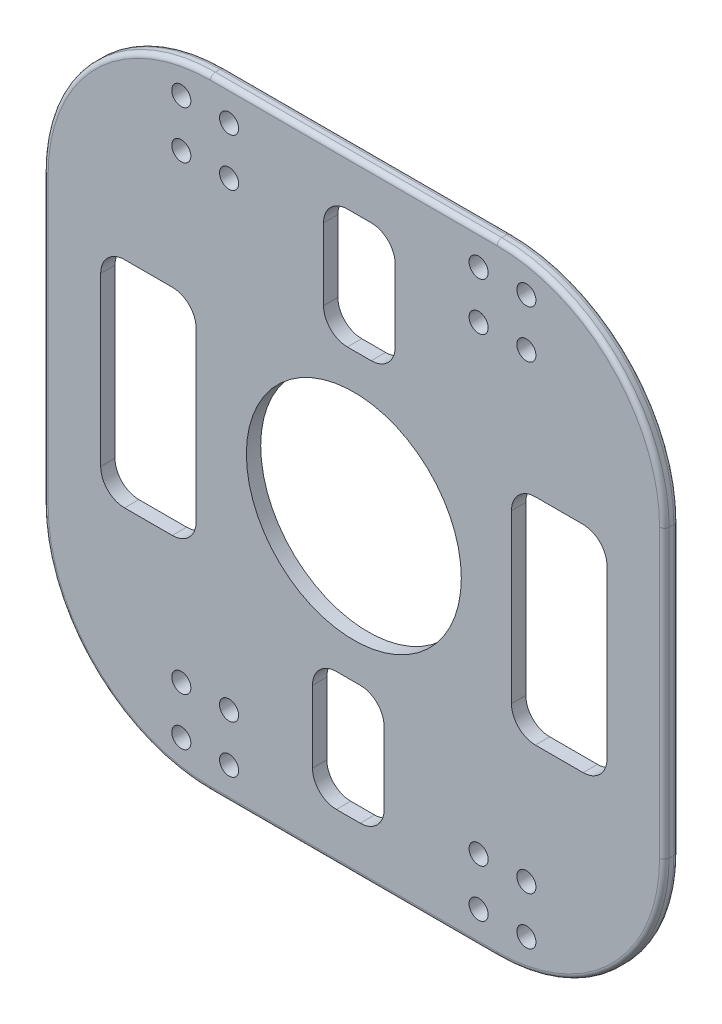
ISO-10303-21;
HEADER;
FILE_DESCRIPTION(('STEP AP214'),'2;1');
FILE_NAME('part.step','',(''),(''),'','','');
FILE_SCHEMA(('AUTOMOTIVE_DESIGN { 1 0 10303 214 1 1 1 1 }'));
ENDSEC;
DATA;
#1=APPLICATION_CONTEXT('core data for automotive mechanical design processes');
#2=APPLICATION_PROTOCOL_DEFINITION('international standard','automotive_design',2000,#1);
#3=PRODUCT_CONTEXT('',#1,'mechanical');
#4=PRODUCT('Part','Part','',(#3));
#5=PRODUCT_RELATED_PRODUCT_CATEGORY('part','',(#4));
#6=PRODUCT_DEFINITION_FORMATION('','',#4);
#7=PRODUCT_DEFINITION_CONTEXT('part definition',#1,'design');
#8=PRODUCT_DEFINITION('design','',#6,#7);
#9=PRODUCT_DEFINITION_SHAPE('','',#8);
#10=(LENGTH_UNIT() NAMED_UNIT(*) SI_UNIT(.MILLI.,.METRE.));
#11=(NAMED_UNIT(*) PLANE_ANGLE_UNIT() SI_UNIT($,.RADIAN.));
#12=(NAMED_UNIT(*) SI_UNIT($,.STERADIAN.) SOLID_ANGLE_UNIT());
#13=UNCERTAINTY_MEASURE_WITH_UNIT(LENGTH_MEASURE(1.E-05),#10,'distance_accuracy_value','');
#14=(GEOMETRIC_REPRESENTATION_CONTEXT(3) GLOBAL_UNCERTAINTY_ASSIGNED_CONTEXT((#13)) GLOBAL_UNIT_ASSIGNED_CONTEXT((#10,
#11,#12)) REPRESENTATION_CONTEXT('',''));
#15=CARTESIAN_POINT('',(0.,0.,0.));
#16=DIRECTION('',(0.,0.,1.));
#17=DIRECTION('',(1.,0.,0.));
#18=AXIS2_PLACEMENT_3D('',#15,#16,#17);
#19=CARTESIAN_POINT('',(65.,65.,-3.));
#20=DIRECTION('',(1.,0.,0.));
#21=DIRECTION('',(0.,1.,0.));
#22=AXIS2_PLACEMENT_3D('',#19,#20,#21);
#23=PLANE('',#22);
#24=DIRECTION('',(0.,0.,1.));
#25=VECTOR('',#24,1.);
#26=CARTESIAN_POINT('',(65.,30.,-3.));
#27=LINE('',#26,#25);
#28=CARTESIAN_POINT('',(65.,30.,-2.));
#29=VERTEX_POINT('',#28);
#30=CARTESIAN_POINT('',(65.,30.,-1.));
#31=VERTEX_POINT('',#30);
#32=EDGE_CURVE('E808',#29,#31,#27,.T.);
#33=ORIENTED_EDGE('',*,*,#32,.T.);
#34=DIRECTION('',(0.,1.,0.));
#35=VECTOR('',#34,1.);
#36=CARTESIAN_POINT('',(65.,65.,-1.));
#37=LINE('',#36,#35);
#38=CARTESIAN_POINT('',(65.,-30.,-1.));
#39=VERTEX_POINT('',#38);
#40=EDGE_CURVE('E452',#31,#39,#37,.F.);
#41=ORIENTED_EDGE('',*,*,#40,.T.);
#42=DIRECTION('',(0.,0.,1.));
#43=VECTOR('',#42,1.);
#44=CARTESIAN_POINT('',(65.,-30.,-3.));
#45=LINE('',#44,#43);
#46=CARTESIAN_POINT('',(65.,-30.,-2.));
#47=VERTEX_POINT('',#46);
#48=EDGE_CURVE('E803',#39,#47,#45,.F.);
#49=ORIENTED_EDGE('',*,*,#48,.T.);
#50=DIRECTION('',(0.,1.,0.));
#51=VECTOR('',#50,1.);
#52=CARTESIAN_POINT('',(65.,30.,-2.));
#53=LINE('',#52,#51);
#54=EDGE_CURVE('E450',#47,#29,#53,.T.);
#55=ORIENTED_EDGE('',*,*,#54,.T.);
#56=EDGE_LOOP('',(#33,#41,#49,#55));
#57=FACE_BOUND('',#56,.T.);
#58=ADVANCED_FACE('F34',(#57),#23,.T.);
#59=CARTESIAN_POINT('',(-65.,-65.,-3.));
#60=DIRECTION('',(0.,-1.,0.));
#61=DIRECTION('',(0.,0.,-1.));
#62=AXIS2_PLACEMENT_3D('',#59,#60,#61);
#63=PLANE('',#62);
#64=DIRECTION('',(0.,0.,1.));
#65=VECTOR('',#64,1.);
#66=CARTESIAN_POINT('',(30.,-65.,-3.));
#67=LINE('',#66,#65);
#68=CARTESIAN_POINT('',(30.,-65.,-2.));
#69=VERTEX_POINT('',#68);
#70=CARTESIAN_POINT('',(30.,-65.,-1.));
#71=VERTEX_POINT('',#70);
#72=EDGE_CURVE('E572',#69,#71,#67,.T.);
#73=ORIENTED_EDGE('',*,*,#72,.T.);
#74=DIRECTION('',(1.,0.,0.));
#75=VECTOR('',#74,1.);
#76=CARTESIAN_POINT('',(-65.,-65.,-1.));
#77=LINE('',#76,#75);
#78=CARTESIAN_POINT('',(-30.,-65.,-1.));
#79=VERTEX_POINT('',#78);
#80=EDGE_CURVE('E460',#71,#79,#77,.F.);
#81=ORIENTED_EDGE('',*,*,#80,.T.);
#82=DIRECTION('',(0.,0.,1.));
#83=VECTOR('',#82,1.);
#84=CARTESIAN_POINT('',(-30.,-65.,-3.));
#85=LINE('',#84,#83);
#86=CARTESIAN_POINT('',(-30.,-65.,-2.));
#87=VERTEX_POINT('',#86);
#88=EDGE_CURVE('E568',#79,#87,#85,.F.);
#89=ORIENTED_EDGE('',*,*,#88,.T.);
#90=DIRECTION('',(1.,0.,0.));
#91=VECTOR('',#90,1.);
#92=CARTESIAN_POINT('',(30.,-65.,-2.));
#93=LINE('',#92,#91);
#94=EDGE_CURVE('E458',#87,#69,#93,.T.);
#95=ORIENTED_EDGE('',*,*,#94,.T.);
#96=EDGE_LOOP('',(#73,#81,#89,#95));
#97=FACE_BOUND('',#96,.T.);
#98=ADVANCED_FACE('F846',(#97),#63,.T.);
#99=CARTESIAN_POINT('',(-65.,65.,-3.));
#100=DIRECTION('',(-1.,0.,0.));
#101=DIRECTION('',(0.,-1.,0.));
#102=AXIS2_PLACEMENT_3D('',#99,#100,#101);
#103=PLANE('',#102);
#104=DIRECTION('',(0.,0.,1.));
#105=VECTOR('',#104,1.);
#106=CARTESIAN_POINT('',(-65.,-30.,-3.));
#107=LINE('',#106,#105);
#108=CARTESIAN_POINT('',(-65.,-30.,-2.));
#109=VERTEX_POINT('',#108);
#110=CARTESIAN_POINT('',(-65.,-30.,-1.));
#111=VERTEX_POINT('',#110);
#112=EDGE_CURVE('E569',#109,#111,#107,.T.);
#113=ORIENTED_EDGE('',*,*,#112,.T.);
#114=DIRECTION('',(0.,-1.,0.));
#115=VECTOR('',#114,1.);
#116=CARTESIAN_POINT('',(-65.,65.,-1.));
#117=LINE('',#116,#115);
#118=CARTESIAN_POINT('',(-65.,30.,-1.));
#119=VERTEX_POINT('',#118);
#120=EDGE_CURVE('E469',#111,#119,#117,.F.);
#121=ORIENTED_EDGE('',*,*,#120,.T.);
#122=DIRECTION('',(0.,0.,1.));
#123=VECTOR('',#122,1.);
#124=CARTESIAN_POINT('',(-65.,30.,-3.));
#125=LINE('',#124,#123);
#126=CARTESIAN_POINT('',(-65.,30.,-2.));
#127=VERTEX_POINT('',#126);
#128=EDGE_CURVE('E559',#119,#127,#125,.F.);
#129=ORIENTED_EDGE('',*,*,#128,.T.);
#130=DIRECTION('',(0.,-1.,0.));
#131=VECTOR('',#130,1.);
#132=CARTESIAN_POINT('',(-65.,-30.,-2.));
#133=LINE('',#132,#131);
#134=EDGE_CURVE('E466',#127,#109,#133,.T.);
#135=ORIENTED_EDGE('',*,*,#134,.T.);
#136=EDGE_LOOP('',(#113,#121,#129,#135));
#137=FACE_BOUND('',#136,.T.);
#138=ADVANCED_FACE('F565',(#137),#103,.T.);
#139=CARTESIAN_POINT('',(-65.,65.,-3.));
#140=DIRECTION('',(0.,1.,0.));
#141=DIRECTION('',(0.,0.,1.));
#142=AXIS2_PLACEMENT_3D('',#139,#140,#141);
#143=PLANE('',#142);
#144=DIRECTION('',(0.,0.,1.));
#145=VECTOR('',#144,1.);
#146=CARTESIAN_POINT('',(-30.,65.,-3.));
#147=LINE('',#146,#145);
#148=CARTESIAN_POINT('',(-30.,65.,-2.));
#149=VERTEX_POINT('',#148);
#150=CARTESIAN_POINT('',(-30.,65.,-1.));
#151=VERTEX_POINT('',#150);
#152=EDGE_CURVE('E562',#149,#151,#147,.T.);
#153=ORIENTED_EDGE('',*,*,#152,.T.);
#154=DIRECTION('',(-1.,0.,0.));
#155=VECTOR('',#154,1.);
#156=CARTESIAN_POINT('',(-65.,65.,-1.));
#157=LINE('',#156,#155);
#158=CARTESIAN_POINT('',(30.,65.,-1.));
#159=VERTEX_POINT('',#158);
#160=EDGE_CURVE('E443',#151,#159,#157,.F.);
#161=ORIENTED_EDGE('',*,*,#160,.T.);
#162=DIRECTION('',(0.,0.,1.));
#163=VECTOR('',#162,1.);
#164=CARTESIAN_POINT('',(30.,65.,-3.));
#165=LINE('',#164,#163);
#166=CARTESIAN_POINT('',(30.,65.,-2.));
#167=VERTEX_POINT('',#166);
#168=EDGE_CURVE('E574',#159,#167,#165,.F.);
#169=ORIENTED_EDGE('',*,*,#168,.T.);
#170=DIRECTION('',(-1.,0.,0.));
#171=VECTOR('',#170,1.);
#172=CARTESIAN_POINT('',(-30.,65.,-2.));
#173=LINE('',#172,#171);
#174=EDGE_CURVE('E441',#167,#149,#173,.T.);
#175=ORIENTED_EDGE('',*,*,#174,.T.);
#176=EDGE_LOOP('',(#153,#161,#169,#175));
#177=FACE_BOUND('',#176,.T.);
#178=ADVANCED_FACE('F814',(#177),#143,.T.);
#179=CARTESIAN_POINT('',(0.,0.,-3.));
#180=DIRECTION('',(0.,0.,1.));
#181=DIRECTION('',(1.,0.,0.));
#182=AXIS2_PLACEMENT_3D('',#179,#180,#181);
#183=PLANE('',#182);
#184=CARTESIAN_POINT('',(-30.,-30.,-3.));
#185=DIRECTION('',(0.,0.,1.));
#186=DIRECTION('',(1.,0.,0.));
#187=AXIS2_PLACEMENT_3D('',#184,#185,#186);
#188=CIRCLE('',#187,34.);
#189=CARTESIAN_POINT('',(-30.,-64.,-3.));
#190=VERTEX_POINT('',#189);
#191=CARTESIAN_POINT('',(-64.,-30.,-3.));
#192=VERTEX_POINT('',#191);
#193=EDGE_CURVE('E51',#190,#192,#188,.F.);
#194=ORIENTED_EDGE('',*,*,#193,.T.);
#195=DIRECTION('',(0.,-1.,0.));
#196=VECTOR('',#195,1.);
#197=CARTESIAN_POINT('',(-64.,30.,-3.));
#198=LINE('',#197,#196);
#199=CARTESIAN_POINT('',(-64.,30.,-3.));
#200=VERTEX_POINT('',#199);
#201=EDGE_CURVE('E483',#192,#200,#198,.F.);
#202=ORIENTED_EDGE('',*,*,#201,.T.);
#203=CARTESIAN_POINT('',(-30.,30.,-3.));
#204=DIRECTION('',(0.,0.,1.));
#205=DIRECTION('',(1.,0.,0.));
#206=AXIS2_PLACEMENT_3D('',#203,#204,#205);
#207=CIRCLE('',#206,34.);
#208=CARTESIAN_POINT('',(-30.,64.,-3.));
#209=VERTEX_POINT('',#208);
#210=EDGE_CURVE('E471',#200,#209,#207,.F.);
#211=ORIENTED_EDGE('',*,*,#210,.T.);
#212=DIRECTION('',(-1.,0.,0.));
#213=VECTOR('',#212,1.);
#214=CARTESIAN_POINT('',(30.,64.,-3.));
#215=LINE('',#214,#213);
#216=CARTESIAN_POINT('',(30.,64.,-3.));
#217=VERTEX_POINT('',#216);
#218=EDGE_CURVE('E473',#209,#217,#215,.F.);
#219=ORIENTED_EDGE('',*,*,#218,.T.);
#220=CARTESIAN_POINT('',(30.,30.,-3.));
#221=DIRECTION('',(0.,0.,1.));
#222=DIRECTION('',(1.,0.,0.));
#223=AXIS2_PLACEMENT_3D('',#220,#221,#222);
#224=CIRCLE('',#223,34.);
#225=CARTESIAN_POINT('',(64.,30.,-3.));
#226=VERTEX_POINT('',#225);
#227=EDGE_CURVE('E475',#217,#226,#224,.F.);
#228=ORIENTED_EDGE('',*,*,#227,.T.);
#229=DIRECTION('',(0.,1.,0.));
#230=VECTOR('',#229,1.);
#231=CARTESIAN_POINT('',(64.,-30.,-3.));
#232=LINE('',#231,#230);
#233=CARTESIAN_POINT('',(64.,-30.,-3.));
#234=VERTEX_POINT('',#233);
#235=EDGE_CURVE('E477',#226,#234,#232,.F.);
#236=ORIENTED_EDGE('',*,*,#235,.T.);
#237=CARTESIAN_POINT('',(30.,-30.,-3.));
#238=DIRECTION('',(0.,0.,1.));
#239=DIRECTION('',(1.,0.,0.));
#240=AXIS2_PLACEMENT_3D('',#237,#238,#239);
#241=CIRCLE('',#240,34.);
#242=CARTESIAN_POINT('',(30.,-64.,-3.));
#243=VERTEX_POINT('',#242);
#244=EDGE_CURVE('E479',#234,#243,#241,.F.);
#245=ORIENTED_EDGE('',*,*,#244,.T.);
#246=DIRECTION('',(1.,0.,0.));
#247=VECTOR('',#246,1.);
#248=CARTESIAN_POINT('',(-30.,-64.,-3.));
#249=LINE('',#248,#247);
#250=EDGE_CURVE('E56',#243,#190,#249,.F.);
#251=ORIENTED_EDGE('',*,*,#250,.T.);
#252=EDGE_LOOP('',(#194,#202,#211,#219,#228,#236,#245,#251));
#253=FACE_BOUND('',#252,.T.);
#254=CARTESIAN_POINT('',(26.1191113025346,48.196758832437,-3.));
#255=DIRECTION('',(0.,0.,-1.));
#256=DIRECTION('',(-1.,0.,0.));
#257=AXIS2_PLACEMENT_3D('',#254,#255,#256);
#258=CIRCLE('',#257,2.);
#259=CARTESIAN_POINT('',(24.1191113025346,48.196758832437,-3.));
#260=VERTEX_POINT('',#259);
#261=EDGE_CURVE('E508',#260,#260,#258,.T.);
#262=ORIENTED_EDGE('',*,*,#261,.F.);
#263=EDGE_LOOP('',(#262));
#264=FACE_BOUND('',#263,.T.);
#265=CARTESIAN_POINT('',(26.1191113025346,58.196758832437,-3.));
#266=DIRECTION('',(0.,0.,-1.));
#267=DIRECTION('',(-1.,0.,0.));
#268=AXIS2_PLACEMENT_3D('',#265,#266,#267);
#269=CIRCLE('',#268,2.);
#270=CARTESIAN_POINT('',(24.1191113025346,58.196758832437,-3.));
#271=VERTEX_POINT('',#270);
#272=EDGE_CURVE('E682',#271,#271,#269,.T.);
#273=ORIENTED_EDGE('',*,*,#272,.F.);
#274=EDGE_LOOP('',(#273));
#275=FACE_BOUND('',#274,.T.);
#276=CARTESIAN_POINT('',(36.1191113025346,58.1967588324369,-3.));
#277=DIRECTION('',(0.,0.,-1.));
#278=DIRECTION('',(-1.,0.,0.));
#279=AXIS2_PLACEMENT_3D('',#276,#277,#278);
#280=CIRCLE('',#279,2.);
#281=CARTESIAN_POINT('',(34.1191113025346,58.1967588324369,-3.));
#282=VERTEX_POINT('',#281);
#283=EDGE_CURVE('E678',#282,#282,#280,.T.);
#284=ORIENTED_EDGE('',*,*,#283,.F.);
#285=EDGE_LOOP('',(#284));
#286=FACE_BOUND('',#285,.T.);
#287=CARTESIAN_POINT('',(36.1191113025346,48.1967588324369,-3.));
#288=DIRECTION('',(0.,0.,-1.));
#289=DIRECTION('',(-1.,0.,0.));
#290=AXIS2_PLACEMENT_3D('',#287,#288,#289);
#291=CIRCLE('',#290,2.);
#292=CARTESIAN_POINT('',(34.1191113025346,48.1967588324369,-3.));
#293=VERTEX_POINT('',#292);
#294=EDGE_CURVE('E674',#293,#293,#291,.T.);
#295=ORIENTED_EDGE('',*,*,#294,.F.);
#296=EDGE_LOOP('',(#295));
#297=FACE_BOUND('',#296,.T.);
#298=CARTESIAN_POINT('',(26.1191113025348,-48.1967588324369,-3.));
#299=DIRECTION('',(0.,0.,-1.));
#300=DIRECTION('',(-1.,0.,0.));
#301=AXIS2_PLACEMENT_3D('',#298,#299,#300);
#302=CIRCLE('',#301,2.);
#303=CARTESIAN_POINT('',(24.1191113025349,-48.1967588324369,-3.));
#304=VERTEX_POINT('',#303);
#305=EDGE_CURVE('E670',#304,#304,#302,.T.);
#306=ORIENTED_EDGE('',*,*,#305,.F.);
#307=EDGE_LOOP('',(#306));
#308=FACE_BOUND('',#307,.T.);
#309=CARTESIAN_POINT('',(-26.1191113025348,-48.1967588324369,-3.));
#310=DIRECTION('',(0.,0.,-1.));
#311=DIRECTION('',(-1.,0.,0.));
#312=AXIS2_PLACEMENT_3D('',#309,#310,#311);
#313=CIRCLE('',#312,2.);
#314=CARTESIAN_POINT('',(-28.1191113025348,-48.1967588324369,-3.));
#315=VERTEX_POINT('',#314);
#316=EDGE_CURVE('E666',#315,#315,#313,.T.);
#317=ORIENTED_EDGE('',*,*,#316,.F.);
#318=EDGE_LOOP('',(#317));
#319=FACE_BOUND('',#318,.T.);
#320=CARTESIAN_POINT('',(26.119111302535,-58.1967588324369,-3.));
#321=DIRECTION('',(0.,0.,-1.));
#322=DIRECTION('',(-1.,0.,0.));
#323=AXIS2_PLACEMENT_3D('',#320,#321,#322);
#324=CIRCLE('',#323,2.);
#325=CARTESIAN_POINT('',(24.119111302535,-58.1967588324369,-3.));
#326=VERTEX_POINT('',#325);
#327=EDGE_CURVE('E662',#326,#326,#324,.T.);
#328=ORIENTED_EDGE('',*,*,#327,.F.);
#329=EDGE_LOOP('',(#328));
#330=FACE_BOUND('',#329,.T.);
#331=CARTESIAN_POINT('',(36.1191113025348,-48.1967588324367,-3.));
#332=DIRECTION('',(0.,0.,-1.));
#333=DIRECTION('',(-1.,0.,0.));
#334=AXIS2_PLACEMENT_3D('',#331,#332,#333);
#335=CIRCLE('',#334,2.);
#336=CARTESIAN_POINT('',(34.1191113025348,-48.1967588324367,-3.));
#337=VERTEX_POINT('',#336);
#338=EDGE_CURVE('E658',#337,#337,#335,.T.);
#339=ORIENTED_EDGE('',*,*,#338,.F.);
#340=EDGE_LOOP('',(#339));
#341=FACE_BOUND('',#340,.T.);
#342=CARTESIAN_POINT('',(-36.119111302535,-58.1967588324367,-3.));
#343=DIRECTION('',(0.,0.,-1.));
#344=DIRECTION('',(-1.,0.,0.));
#345=AXIS2_PLACEMENT_3D('',#342,#343,#344);
#346=CIRCLE('',#345,2.);
#347=CARTESIAN_POINT('',(-38.119111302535,-58.1967588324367,-3.));
#348=VERTEX_POINT('',#347);
#349=EDGE_CURVE('E654',#348,#348,#346,.T.);
#350=ORIENTED_EDGE('',*,*,#349,.F.);
#351=EDGE_LOOP('',(#350));
#352=FACE_BOUND('',#351,.T.);
#353=CARTESIAN_POINT('',(-36.1191113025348,-48.1967588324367,-3.));
#354=DIRECTION('',(0.,0.,-1.));
#355=DIRECTION('',(-1.,0.,0.));
#356=AXIS2_PLACEMENT_3D('',#353,#354,#355);
#357=CIRCLE('',#356,2.);
#358=CARTESIAN_POINT('',(-38.1191113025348,-48.1967588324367,-3.));
#359=VERTEX_POINT('',#358);
#360=EDGE_CURVE('E650',#359,#359,#357,.T.);
#361=ORIENTED_EDGE('',*,*,#360,.F.);
#362=EDGE_LOOP('',(#361));
#363=FACE_BOUND('',#362,.T.);
#364=CARTESIAN_POINT('',(-26.119111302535,-58.1967588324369,-3.));
#365=DIRECTION('',(0.,0.,-1.));
#366=DIRECTION('',(-1.,0.,0.));
#367=AXIS2_PLACEMENT_3D('',#364,#365,#366);
#368=CIRCLE('',#367,2.);
#369=CARTESIAN_POINT('',(-28.119111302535,-58.1967588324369,-3.));
#370=VERTEX_POINT('',#369);
#371=EDGE_CURVE('E646',#370,#370,#368,.T.);
#372=ORIENTED_EDGE('',*,*,#371,.F.);
#373=EDGE_LOOP('',(#372));
#374=FACE_BOUND('',#373,.T.);
#375=CARTESIAN_POINT('',(-26.1191113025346,48.196758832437,-3.));
#376=DIRECTION('',(0.,0.,-1.));
#377=DIRECTION('',(-1.,0.,0.));
#378=AXIS2_PLACEMENT_3D('',#375,#376,#377);
#379=CIRCLE('',#378,2.);
#380=CARTESIAN_POINT('',(-28.1191113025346,48.196758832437,-3.));
#381=VERTEX_POINT('',#380);
#382=EDGE_CURVE('E642',#381,#381,#379,.T.);
#383=ORIENTED_EDGE('',*,*,#382,.F.);
#384=EDGE_LOOP('',(#383));
#385=FACE_BOUND('',#384,.T.);
#386=CARTESIAN_POINT('',(-26.1191113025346,58.196758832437,-3.));
#387=DIRECTION('',(0.,0.,-1.));
#388=DIRECTION('',(-1.,0.,0.));
#389=AXIS2_PLACEMENT_3D('',#386,#387,#388);
#390=CIRCLE('',#389,2.);
#391=CARTESIAN_POINT('',(-28.1191113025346,58.196758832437,-3.));
#392=VERTEX_POINT('',#391);
#393=EDGE_CURVE('E638',#392,#392,#390,.T.);
#394=ORIENTED_EDGE('',*,*,#393,.F.);
#395=EDGE_LOOP('',(#394));
#396=FACE_BOUND('',#395,.T.);
#397=DIRECTION('',(0.,-1.,0.));
#398=VECTOR('',#397,1.);
#399=CARTESIAN_POINT('',(6.34484379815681,-30.,-3.));
#400=LINE('',#399,#398);
#401=CARTESIAN_POINT('',(6.34484379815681,-35.,-3.));
#402=VERTEX_POINT('',#401);
#403=CARTESIAN_POINT('',(6.34484379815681,-50.,-3.));
#404=VERTEX_POINT('',#403);
#405=EDGE_CURVE('E1612',#402,#404,#400,.T.);
#406=ORIENTED_EDGE('',*,*,#405,.F.);
#407=CARTESIAN_POINT('',(1.34484379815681,-35.,-3.));
#408=DIRECTION('',(0.,0.,1.));
#409=DIRECTION('',(1.,0.,0.));
#410=AXIS2_PLACEMENT_3D('',#407,#408,#409);
#411=CIRCLE('',#410,5.);
#412=CARTESIAN_POINT('',(1.34484379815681,-30.,-3.));
#413=VERTEX_POINT('',#412);
#414=EDGE_CURVE('E408',#402,#413,#411,.T.);
#415=ORIENTED_EDGE('',*,*,#414,.T.);
#416=DIRECTION('',(1.,0.,0.));
#417=VECTOR('',#416,1.);
#418=CARTESIAN_POINT('',(-8.65515620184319,-30.,-3.));
#419=LINE('',#418,#417);
#420=CARTESIAN_POINT('',(-3.65515620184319,-30.,-3.));
#421=VERTEX_POINT('',#420);
#422=EDGE_CURVE('E637',#421,#413,#419,.T.);
#423=ORIENTED_EDGE('',*,*,#422,.F.);
#424=CARTESIAN_POINT('',(-3.65515620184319,-35.,-3.));
#425=DIRECTION('',(0.,0.,1.));
#426=DIRECTION('',(1.,0.,0.));
#427=AXIS2_PLACEMENT_3D('',#424,#425,#426);
#428=CIRCLE('',#427,5.);
#429=CARTESIAN_POINT('',(-8.65515620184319,-35.,-3.));
#430=VERTEX_POINT('',#429);
#431=EDGE_CURVE('E396',#421,#430,#428,.T.);
#432=ORIENTED_EDGE('',*,*,#431,.T.);
#433=DIRECTION('',(0.,1.,0.));
#434=VECTOR('',#433,1.);
#435=CARTESIAN_POINT('',(-8.6551562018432,-55.,-3.));
#436=LINE('',#435,#434);
#437=CARTESIAN_POINT('',(-8.65515620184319,-50.,-3.));
#438=VERTEX_POINT('',#437);
#439=EDGE_CURVE('E1606',#438,#430,#436,.T.);
#440=ORIENTED_EDGE('',*,*,#439,.F.);
#441=CARTESIAN_POINT('',(-3.65515620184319,-50.,-3.));
#442=DIRECTION('',(0.,0.,1.));
#443=DIRECTION('',(1.,0.,0.));
#444=AXIS2_PLACEMENT_3D('',#441,#442,#443);
#445=CIRCLE('',#444,5.);
#446=CARTESIAN_POINT('',(-3.6551562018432,-55.,-3.));
#447=VERTEX_POINT('',#446);
#448=EDGE_CURVE('E400',#438,#447,#445,.T.);
#449=ORIENTED_EDGE('',*,*,#448,.T.);
#450=DIRECTION('',(-1.,0.,0.));
#451=VECTOR('',#450,1.);
#452=CARTESIAN_POINT('',(6.3448437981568,-55.,-3.));
#453=LINE('',#452,#451);
#454=CARTESIAN_POINT('',(1.34484379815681,-55.,-3.));
#455=VERTEX_POINT('',#454);
#456=EDGE_CURVE('E1609',#455,#447,#453,.T.);
#457=ORIENTED_EDGE('',*,*,#456,.F.);
#458=CARTESIAN_POINT('',(1.34484379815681,-50.,-3.));
#459=DIRECTION('',(0.,0.,1.));
#460=DIRECTION('',(1.,0.,0.));
#461=AXIS2_PLACEMENT_3D('',#458,#459,#460);
#462=CIRCLE('',#461,5.);
#463=EDGE_CURVE('E404',#455,#404,#462,.T.);
#464=ORIENTED_EDGE('',*,*,#463,.T.);
#465=EDGE_LOOP('',(#406,#415,#423,#432,#440,#449,#457,#464));
#466=FACE_BOUND('',#465,.T.);
#467=DIRECTION('',(0.,-1.,0.));
#468=VECTOR('',#467,1.);
#469=CARTESIAN_POINT('',(-33.,22.5,-3.));
#470=LINE('',#469,#468);
#471=CARTESIAN_POINT('',(-33.,17.5,-3.));
#472=VERTEX_POINT('',#471);
#473=CARTESIAN_POINT('',(-33.,-17.5,-3.));
#474=VERTEX_POINT('',#473);
#475=EDGE_CURVE('E1600',#472,#474,#470,.T.);
#476=ORIENTED_EDGE('',*,*,#475,.F.);
#477=CARTESIAN_POINT('',(-38.,17.5,-3.));
#478=DIRECTION('',(0.,0.,1.));
#479=DIRECTION('',(1.,0.,0.));
#480=AXIS2_PLACEMENT_3D('',#477,#478,#479);
#481=CIRCLE('',#480,5.);
#482=CARTESIAN_POINT('',(-38.,22.5,-3.));
#483=VERTEX_POINT('',#482);
#484=EDGE_CURVE('E392',#472,#483,#481,.T.);
#485=ORIENTED_EDGE('',*,*,#484,.T.);
#486=DIRECTION('',(1.,0.,0.));
#487=VECTOR('',#486,1.);
#488=CARTESIAN_POINT('',(-53.,22.5,-3.));
#489=LINE('',#488,#487);
#490=CARTESIAN_POINT('',(-48.,22.5,-3.));
#491=VERTEX_POINT('',#490);
#492=EDGE_CURVE('E1603',#491,#483,#489,.T.);
#493=ORIENTED_EDGE('',*,*,#492,.F.);
#494=CARTESIAN_POINT('',(-48.,17.5,-3.));
#495=DIRECTION('',(0.,0.,1.));
#496=DIRECTION('',(1.,0.,0.));
#497=AXIS2_PLACEMENT_3D('',#494,#495,#496);
#498=CIRCLE('',#497,5.);
#499=CARTESIAN_POINT('',(-53.,17.5,-3.));
#500=VERTEX_POINT('',#499);
#501=EDGE_CURVE('E380',#491,#500,#498,.T.);
#502=ORIENTED_EDGE('',*,*,#501,.T.);
#503=DIRECTION('',(0.,1.,0.));
#504=VECTOR('',#503,1.);
#505=CARTESIAN_POINT('',(-53.,22.5,-3.));
#506=LINE('',#505,#504);
#507=CARTESIAN_POINT('',(-53.,-17.5,-3.));
#508=VERTEX_POINT('',#507);
#509=EDGE_CURVE('E1594',#508,#500,#506,.T.);
#510=ORIENTED_EDGE('',*,*,#509,.F.);
#511=CARTESIAN_POINT('',(-48.,-17.5,-3.));
#512=DIRECTION('',(0.,0.,1.));
#513=DIRECTION('',(1.,0.,0.));
#514=AXIS2_PLACEMENT_3D('',#511,#512,#513);
#515=CIRCLE('',#514,5.);
#516=CARTESIAN_POINT('',(-48.,-22.5,-3.));
#517=VERTEX_POINT('',#516);
#518=EDGE_CURVE('E384',#508,#517,#515,.T.);
#519=ORIENTED_EDGE('',*,*,#518,.T.);
#520=DIRECTION('',(-1.,0.,0.));
#521=VECTOR('',#520,1.);
#522=CARTESIAN_POINT('',(-53.,-22.5,-3.));
#523=LINE('',#522,#521);
#524=CARTESIAN_POINT('',(-38.,-22.5,-3.));
#525=VERTEX_POINT('',#524);
#526=EDGE_CURVE('E1597',#525,#517,#523,.T.);
#527=ORIENTED_EDGE('',*,*,#526,.F.);
#528=CARTESIAN_POINT('',(-38.,-17.5,-3.));
#529=DIRECTION('',(0.,0.,1.));
#530=DIRECTION('',(1.,0.,0.));
#531=AXIS2_PLACEMENT_3D('',#528,#529,#530);
#532=CIRCLE('',#531,5.);
#533=EDGE_CURVE('E388',#525,#474,#532,.T.);
#534=ORIENTED_EDGE('',*,*,#533,.T.);
#535=EDGE_LOOP('',(#476,#485,#493,#502,#510,#519,#527,#534));
#536=FACE_BOUND('',#535,.T.);
#537=DIRECTION('',(0.,1.,0.));
#538=VECTOR('',#537,1.);
#539=CARTESIAN_POINT('',(-6.34484379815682,30.,-3.));
#540=LINE('',#539,#538);
#541=CARTESIAN_POINT('',(-6.34484379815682,35.,-3.));
#542=VERTEX_POINT('',#541);
#543=CARTESIAN_POINT('',(-6.34484379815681,50.,-3.));
#544=VERTEX_POINT('',#543);
#545=EDGE_CURVE('E1588',#542,#544,#540,.T.);
#546=ORIENTED_EDGE('',*,*,#545,.F.);
#547=CARTESIAN_POINT('',(-1.34484379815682,35.,-3.));
#548=DIRECTION('',(0.,0.,1.));
#549=DIRECTION('',(1.,0.,0.));
#550=AXIS2_PLACEMENT_3D('',#547,#548,#549);
#551=CIRCLE('',#550,5.);
#552=CARTESIAN_POINT('',(-1.34484379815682,30.,-3.));
#553=VERTEX_POINT('',#552);
#554=EDGE_CURVE('E412',#542,#553,#551,.T.);
#555=ORIENTED_EDGE('',*,*,#554,.T.);
#556=DIRECTION('',(-1.,0.,0.));
#557=VECTOR('',#556,1.);
#558=CARTESIAN_POINT('',(8.65515620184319,30.,-3.));
#559=LINE('',#558,#557);
#560=CARTESIAN_POINT('',(3.65515620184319,30.,-3.));
#561=VERTEX_POINT('',#560);
#562=EDGE_CURVE('E1591',#561,#553,#559,.T.);
#563=ORIENTED_EDGE('',*,*,#562,.F.);
#564=CARTESIAN_POINT('',(3.65515620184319,35.,-3.));
#565=DIRECTION('',(0.,0.,1.));
#566=DIRECTION('',(1.,0.,0.));
#567=AXIS2_PLACEMENT_3D('',#564,#565,#566);
#568=CIRCLE('',#567,5.);
#569=CARTESIAN_POINT('',(8.65515620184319,35.,-3.));
#570=VERTEX_POINT('',#569);
#571=EDGE_CURVE('E420',#561,#570,#568,.T.);
#572=ORIENTED_EDGE('',*,*,#571,.T.);
#573=DIRECTION('',(0.,-1.,0.));
#574=VECTOR('',#573,1.);
#575=CARTESIAN_POINT('',(8.65515620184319,55.,-3.));
#576=LINE('',#575,#574);
#577=CARTESIAN_POINT('',(8.65515620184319,50.,-3.));
#578=VERTEX_POINT('',#577);
#579=EDGE_CURVE('E1581',#578,#570,#576,.T.);
#580=ORIENTED_EDGE('',*,*,#579,.F.);
#581=CARTESIAN_POINT('',(3.65515620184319,50.,-3.));
#582=DIRECTION('',(0.,0.,1.));
#583=DIRECTION('',(1.,0.,0.));
#584=AXIS2_PLACEMENT_3D('',#581,#582,#583);
#585=CIRCLE('',#584,5.);
#586=CARTESIAN_POINT('',(3.65515620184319,55.,-3.));
#587=VERTEX_POINT('',#586);
#588=EDGE_CURVE('E416',#578,#587,#585,.T.);
#589=ORIENTED_EDGE('',*,*,#588,.T.);
#590=DIRECTION('',(1.,0.,0.));
#591=VECTOR('',#590,1.);
#592=CARTESIAN_POINT('',(-6.34484379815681,55.,-3.));
#593=LINE('',#592,#591);
#594=CARTESIAN_POINT('',(-1.34484379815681,55.,-3.));
#595=VERTEX_POINT('',#594);
#596=EDGE_CURVE('E1583',#595,#587,#593,.T.);
#597=ORIENTED_EDGE('',*,*,#596,.F.);
#598=CARTESIAN_POINT('',(-1.34484379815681,50.,-3.));
#599=DIRECTION('',(0.,0.,1.));
#600=DIRECTION('',(1.,0.,0.));
#601=AXIS2_PLACEMENT_3D('',#598,#599,#600);
#602=CIRCLE('',#601,5.);
#603=EDGE_CURVE('E370',#595,#544,#602,.T.);
#604=ORIENTED_EDGE('',*,*,#603,.T.);
#605=EDGE_LOOP('',(#546,#555,#563,#572,#580,#589,#597,#604));
#606=FACE_BOUND('',#605,.T.);
#607=CARTESIAN_POINT('',(36.119111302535,-58.1967588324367,-3.));
#608=DIRECTION('',(0.,0.,-1.));
#609=DIRECTION('',(-1.,0.,0.));
#610=AXIS2_PLACEMENT_3D('',#607,#608,#609);
#611=CIRCLE('',#610,2.);
#612=CARTESIAN_POINT('',(34.119111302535,-58.1967588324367,-3.));
#613=VERTEX_POINT('',#612);
#614=EDGE_CURVE('E599',#613,#613,#611,.T.);
#615=ORIENTED_EDGE('',*,*,#614,.F.);
#616=EDGE_LOOP('',(#615));
#617=FACE_BOUND('',#616,.T.);
#618=DIRECTION('',(-1.,0.,0.));
#619=VECTOR('',#618,1.);
#620=CARTESIAN_POINT('',(53.,-22.5,-3.));
#621=LINE('',#620,#619);
#622=CARTESIAN_POINT('',(48.,-22.5,-3.));
#623=VERTEX_POINT('',#622);
#624=CARTESIAN_POINT('',(38.,-22.5,-3.));
#625=VERTEX_POINT('',#624);
#626=EDGE_CURVE('E784',#623,#625,#621,.T.);
#627=ORIENTED_EDGE('',*,*,#626,.F.);
#628=CARTESIAN_POINT('',(48.,-17.5,-3.));
#629=DIRECTION('',(0.,0.,1.));
#630=DIRECTION('',(1.,0.,0.));
#631=AXIS2_PLACEMENT_3D('',#628,#629,#630);
#632=CIRCLE('',#631,5.);
#633=CARTESIAN_POINT('',(53.,-17.5,-3.));
#634=VERTEX_POINT('',#633);
#635=EDGE_CURVE('E371',#623,#634,#632,.T.);
#636=ORIENTED_EDGE('',*,*,#635,.T.);
#637=DIRECTION('',(0.,-1.,0.));
#638=VECTOR('',#637,1.);
#639=CARTESIAN_POINT('',(53.,22.5,-3.));
#640=LINE('',#639,#638);
#641=CARTESIAN_POINT('',(53.,17.5,-3.));
#642=VERTEX_POINT('',#641);
#643=EDGE_CURVE('E348',#642,#634,#640,.T.);
#644=ORIENTED_EDGE('',*,*,#643,.F.);
#645=CARTESIAN_POINT('',(48.,17.5,-3.));
#646=DIRECTION('',(0.,0.,1.));
#647=DIRECTION('',(1.,0.,0.));
#648=AXIS2_PLACEMENT_3D('',#645,#646,#647);
#649=CIRCLE('',#648,5.);
#650=CARTESIAN_POINT('',(48.,22.5,-3.));
#651=VERTEX_POINT('',#650);
#652=EDGE_CURVE('E760',#642,#651,#649,.T.);
#653=ORIENTED_EDGE('',*,*,#652,.T.);
#654=DIRECTION('',(1.,0.,0.));
#655=VECTOR('',#654,1.);
#656=CARTESIAN_POINT('',(53.,22.5,-3.));
#657=LINE('',#656,#655);
#658=CARTESIAN_POINT('',(38.,22.5,-3.));
#659=VERTEX_POINT('',#658);
#660=EDGE_CURVE('E789',#659,#651,#657,.T.);
#661=ORIENTED_EDGE('',*,*,#660,.F.);
#662=CARTESIAN_POINT('',(38.,17.5,-3.));
#663=DIRECTION('',(0.,0.,1.));
#664=DIRECTION('',(1.,0.,0.));
#665=AXIS2_PLACEMENT_3D('',#662,#663,#664);
#666=CIRCLE('',#665,5.);
#667=CARTESIAN_POINT('',(33.,17.5,-3.));
#668=VERTEX_POINT('',#667);
#669=EDGE_CURVE('E763',#659,#668,#666,.T.);
#670=ORIENTED_EDGE('',*,*,#669,.T.);
#671=DIRECTION('',(0.,1.,0.));
#672=VECTOR('',#671,1.);
#673=CARTESIAN_POINT('',(33.,22.5,-3.));
#674=LINE('',#673,#672);
#675=CARTESIAN_POINT('',(33.,-17.5,-3.));
#676=VERTEX_POINT('',#675);
#677=EDGE_CURVE('E785',#676,#668,#674,.T.);
#678=ORIENTED_EDGE('',*,*,#677,.F.);
#679=CARTESIAN_POINT('',(38.,-17.5,-3.));
#680=DIRECTION('',(0.,0.,1.));
#681=DIRECTION('',(1.,0.,0.));
#682=AXIS2_PLACEMENT_3D('',#679,#680,#681);
#683=CIRCLE('',#682,5.);
#684=EDGE_CURVE('E767',#676,#625,#683,.T.);
#685=ORIENTED_EDGE('',*,*,#684,.T.);
#686=EDGE_LOOP('',(#627,#636,#644,#653,#661,#670,#678,#685));
#687=FACE_BOUND('',#686,.T.);
#688=CARTESIAN_POINT('',(-36.1191113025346,48.1967588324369,-3.));
#689=DIRECTION('',(0.,0.,-1.));
#690=DIRECTION('',(-1.,0.,0.));
#691=AXIS2_PLACEMENT_3D('',#688,#689,#690);
#692=CIRCLE('',#691,2.);
#693=CARTESIAN_POINT('',(-38.1191113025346,48.1967588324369,-3.));
#694=VERTEX_POINT('',#693);
#695=EDGE_CURVE('E589',#694,#694,#692,.T.);
#696=ORIENTED_EDGE('',*,*,#695,.F.);
#697=EDGE_LOOP('',(#696));
#698=FACE_BOUND('',#697,.T.);
#699=CARTESIAN_POINT('',(-36.1191113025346,58.1967588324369,-3.));
#700=DIRECTION('',(0.,0.,-1.));
#701=DIRECTION('',(-1.,0.,0.));
#702=AXIS2_PLACEMENT_3D('',#699,#700,#701);
#703=CIRCLE('',#702,2.);
#704=CARTESIAN_POINT('',(-38.1191113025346,58.1967588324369,-3.));
#705=VERTEX_POINT('',#704);
#706=EDGE_CURVE('E585',#705,#705,#703,.T.);
#707=ORIENTED_EDGE('',*,*,#706,.F.);
#708=EDGE_LOOP('',(#707));
#709=FACE_BOUND('',#708,.T.);
#710=CARTESIAN_POINT('',(0.,0.,-3.));
#711=DIRECTION('',(0.,0.,1.));
#712=DIRECTION('',(1.,0.,0.));
#713=AXIS2_PLACEMENT_3D('',#710,#711,#712);
#714=CIRCLE('',#713,22.5);
#715=CARTESIAN_POINT('',(22.5,0.,-3.));
#716=VERTEX_POINT('',#715);
#717=EDGE_CURVE('E800',#716,#716,#714,.T.);
#718=ORIENTED_EDGE('',*,*,#717,.T.);
#719=EDGE_LOOP('',(#718));
#720=FACE_BOUND('',#719,.T.);
#721=ADVANCED_FACE('F540',(#253,#264,#275,#286,#297,#308,#319,#330,#341,#352,#363,#374,#385,
#396,#466,#536,#606,#617,#687,#698,#709,#720),#183,.F.);
#722=CARTESIAN_POINT('',(0.,0.,0.));
#723=DIRECTION('',(0.,0.,1.));
#724=DIRECTION('',(1.,0.,0.));
#725=AXIS2_PLACEMENT_3D('',#722,#723,#724);
#726=PLANE('',#725);
#727=CARTESIAN_POINT('',(30.,30.,0.));
#728=DIRECTION('',(0.,0.,1.));
#729=DIRECTION('',(1.,0.,0.));
#730=AXIS2_PLACEMENT_3D('',#727,#728,#729);
#731=CIRCLE('',#730,34.);
#732=CARTESIAN_POINT('',(64.,30.,0.));
#733=VERTEX_POINT('',#732);
#734=CARTESIAN_POINT('',(30.,64.,0.));
#735=VERTEX_POINT('',#734);
#736=EDGE_CURVE('E436',#733,#735,#731,.T.);
#737=ORIENTED_EDGE('',*,*,#736,.T.);
#738=DIRECTION('',(-1.,0.,0.));
#739=VECTOR('',#738,1.);
#740=CARTESIAN_POINT('',(0.,64.,0.));
#741=LINE('',#740,#739);
#742=CARTESIAN_POINT('',(-30.,64.,0.));
#743=VERTEX_POINT('',#742);
#744=EDGE_CURVE('E438',#735,#743,#741,.T.);
#745=ORIENTED_EDGE('',*,*,#744,.T.);
#746=CARTESIAN_POINT('',(-30.,30.,0.));
#747=DIRECTION('',(0.,0.,1.));
#748=DIRECTION('',(1.,0.,0.));
#749=AXIS2_PLACEMENT_3D('',#746,#747,#748);
#750=CIRCLE('',#749,34.);
#751=CARTESIAN_POINT('',(-64.,30.,0.));
#752=VERTEX_POINT('',#751);
#753=EDGE_CURVE('E424',#743,#752,#750,.T.);
#754=ORIENTED_EDGE('',*,*,#753,.T.);
#755=DIRECTION('',(0.,-1.,0.));
#756=VECTOR('',#755,1.);
#757=CARTESIAN_POINT('',(-64.,0.,0.));
#758=LINE('',#757,#756);
#759=CARTESIAN_POINT('',(-64.,-30.,0.));
#760=VERTEX_POINT('',#759);
#761=EDGE_CURVE('E426',#752,#760,#758,.T.);
#762=ORIENTED_EDGE('',*,*,#761,.T.);
#763=CARTESIAN_POINT('',(-30.,-30.,0.));
#764=DIRECTION('',(0.,0.,1.));
#765=DIRECTION('',(1.,0.,0.));
#766=AXIS2_PLACEMENT_3D('',#763,#764,#765);
#767=CIRCLE('',#766,34.);
#768=CARTESIAN_POINT('',(-30.,-64.,0.));
#769=VERTEX_POINT('',#768);
#770=EDGE_CURVE('E428',#760,#769,#767,.T.);
#771=ORIENTED_EDGE('',*,*,#770,.T.);
#772=DIRECTION('',(1.,0.,0.));
#773=VECTOR('',#772,1.);
#774=CARTESIAN_POINT('',(0.,-64.,0.));
#775=LINE('',#774,#773);
#776=CARTESIAN_POINT('',(30.,-64.,0.));
#777=VERTEX_POINT('',#776);
#778=EDGE_CURVE('E430',#769,#777,#775,.T.);
#779=ORIENTED_EDGE('',*,*,#778,.T.);
#780=CARTESIAN_POINT('',(30.,-30.,0.));
#781=DIRECTION('',(0.,0.,1.));
#782=DIRECTION('',(1.,0.,0.));
#783=AXIS2_PLACEMENT_3D('',#780,#781,#782);
#784=CIRCLE('',#783,34.);
#785=CARTESIAN_POINT('',(64.,-30.,0.));
#786=VERTEX_POINT('',#785);
#787=EDGE_CURVE('E432',#777,#786,#784,.T.);
#788=ORIENTED_EDGE('',*,*,#787,.T.);
#789=DIRECTION('',(0.,1.,0.));
#790=VECTOR('',#789,1.);
#791=CARTESIAN_POINT('',(64.,0.,0.));
#792=LINE('',#791,#790);
#793=EDGE_CURVE('E434',#786,#733,#792,.T.);
#794=ORIENTED_EDGE('',*,*,#793,.T.);
#795=EDGE_LOOP('',(#737,#745,#754,#762,#771,#779,#788,#794));
#796=FACE_BOUND('',#795,.T.);
#797=CARTESIAN_POINT('',(26.1191113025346,48.196758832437,0.));
#798=DIRECTION('',(0.,0.,1.));
#799=DIRECTION('',(1.,0.,0.));
#800=AXIS2_PLACEMENT_3D('',#797,#798,#799);
#801=CIRCLE('',#800,2.);
#802=CARTESIAN_POINT('',(28.1191113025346,48.196758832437,0.));
#803=VERTEX_POINT('',#802);
#804=EDGE_CURVE('E683',#803,#803,#801,.T.);
#805=ORIENTED_EDGE('',*,*,#804,.F.);
#806=EDGE_LOOP('',(#805));
#807=FACE_BOUND('',#806,.T.);
#808=CARTESIAN_POINT('',(26.1191113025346,58.196758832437,0.));
#809=DIRECTION('',(0.,0.,1.));
#810=DIRECTION('',(1.,0.,0.));
#811=AXIS2_PLACEMENT_3D('',#808,#809,#810);
#812=CIRCLE('',#811,2.);
#813=CARTESIAN_POINT('',(28.1191113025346,58.196758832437,0.));
#814=VERTEX_POINT('',#813);
#815=EDGE_CURVE('E679',#814,#814,#812,.T.);
#816=ORIENTED_EDGE('',*,*,#815,.F.);
#817=EDGE_LOOP('',(#816));
#818=FACE_BOUND('',#817,.T.);
#819=CARTESIAN_POINT('',(36.1191113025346,58.1967588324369,0.));
#820=DIRECTION('',(0.,0.,1.));
#821=DIRECTION('',(1.,0.,0.));
#822=AXIS2_PLACEMENT_3D('',#819,#820,#821);
#823=CIRCLE('',#822,2.);
#824=CARTESIAN_POINT('',(38.1191113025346,58.1967588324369,0.));
#825=VERTEX_POINT('',#824);
#826=EDGE_CURVE('E675',#825,#825,#823,.T.);
#827=ORIENTED_EDGE('',*,*,#826,.F.);
#828=EDGE_LOOP('',(#827));
#829=FACE_BOUND('',#828,.T.);
#830=CARTESIAN_POINT('',(36.1191113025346,48.1967588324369,0.));
#831=DIRECTION('',(0.,0.,1.));
#832=DIRECTION('',(1.,0.,0.));
#833=AXIS2_PLACEMENT_3D('',#830,#831,#832);
#834=CIRCLE('',#833,2.);
#835=CARTESIAN_POINT('',(38.1191113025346,48.1967588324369,0.));
#836=VERTEX_POINT('',#835);
#837=EDGE_CURVE('E671',#836,#836,#834,.T.);
#838=ORIENTED_EDGE('',*,*,#837,.F.);
#839=EDGE_LOOP('',(#838));
#840=FACE_BOUND('',#839,.T.);
#841=CARTESIAN_POINT('',(26.1191113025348,-48.1967588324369,0.));
#842=DIRECTION('',(0.,0.,1.));
#843=DIRECTION('',(1.,0.,0.));
#844=AXIS2_PLACEMENT_3D('',#841,#842,#843);
#845=CIRCLE('',#844,2.);
#846=CARTESIAN_POINT('',(28.1191113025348,-48.1967588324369,0.));
#847=VERTEX_POINT('',#846);
#848=EDGE_CURVE('E667',#847,#847,#845,.T.);
#849=ORIENTED_EDGE('',*,*,#848,.F.);
#850=EDGE_LOOP('',(#849));
#851=FACE_BOUND('',#850,.T.);
#852=CARTESIAN_POINT('',(-26.1191113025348,-48.1967588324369,0.));
#853=DIRECTION('',(0.,0.,1.));
#854=DIRECTION('',(1.,0.,0.));
#855=AXIS2_PLACEMENT_3D('',#852,#853,#854);
#856=CIRCLE('',#855,2.);
#857=CARTESIAN_POINT('',(-24.1191113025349,-48.1967588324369,0.));
#858=VERTEX_POINT('',#857);
#859=EDGE_CURVE('E663',#858,#858,#856,.T.);
#860=ORIENTED_EDGE('',*,*,#859,.F.);
#861=EDGE_LOOP('',(#860));
#862=FACE_BOUND('',#861,.T.);
#863=CARTESIAN_POINT('',(26.119111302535,-58.1967588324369,0.));
#864=DIRECTION('',(0.,0.,1.));
#865=DIRECTION('',(1.,0.,0.));
#866=AXIS2_PLACEMENT_3D('',#863,#864,#865);
#867=CIRCLE('',#866,2.);
#868=CARTESIAN_POINT('',(28.119111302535,-58.1967588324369,0.));
#869=VERTEX_POINT('',#868);
#870=EDGE_CURVE('E659',#869,#869,#867,.T.);
#871=ORIENTED_EDGE('',*,*,#870,.F.);
#872=EDGE_LOOP('',(#871));
#873=FACE_BOUND('',#872,.T.);
#874=CARTESIAN_POINT('',(36.1191113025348,-48.1967588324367,0.));
#875=DIRECTION('',(0.,0.,1.));
#876=DIRECTION('',(1.,0.,0.));
#877=AXIS2_PLACEMENT_3D('',#874,#875,#876);
#878=CIRCLE('',#877,2.);
#879=CARTESIAN_POINT('',(38.1191113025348,-48.1967588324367,0.));
#880=VERTEX_POINT('',#879);
#881=EDGE_CURVE('E655',#880,#880,#878,.T.);
#882=ORIENTED_EDGE('',*,*,#881,.F.);
#883=EDGE_LOOP('',(#882));
#884=FACE_BOUND('',#883,.T.);
#885=CARTESIAN_POINT('',(-36.119111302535,-58.1967588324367,0.));
#886=DIRECTION('',(0.,0.,1.));
#887=DIRECTION('',(1.,0.,0.));
#888=AXIS2_PLACEMENT_3D('',#885,#886,#887);
#889=CIRCLE('',#888,2.);
#890=CARTESIAN_POINT('',(-34.119111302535,-58.1967588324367,0.));
#891=VERTEX_POINT('',#890);
#892=EDGE_CURVE('E651',#891,#891,#889,.T.);
#893=ORIENTED_EDGE('',*,*,#892,.F.);
#894=EDGE_LOOP('',(#893));
#895=FACE_BOUND('',#894,.T.);
#896=CARTESIAN_POINT('',(-36.1191113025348,-48.1967588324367,0.));
#897=DIRECTION('',(0.,0.,1.));
#898=DIRECTION('',(1.,0.,0.));
#899=AXIS2_PLACEMENT_3D('',#896,#897,#898);
#900=CIRCLE('',#899,2.);
#901=CARTESIAN_POINT('',(-34.1191113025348,-48.1967588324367,0.));
#902=VERTEX_POINT('',#901);
#903=EDGE_CURVE('E647',#902,#902,#900,.T.);
#904=ORIENTED_EDGE('',*,*,#903,.F.);
#905=EDGE_LOOP('',(#904));
#906=FACE_BOUND('',#905,.T.);
#907=CARTESIAN_POINT('',(-26.119111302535,-58.1967588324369,0.));
#908=DIRECTION('',(0.,0.,1.));
#909=DIRECTION('',(1.,0.,0.));
#910=AXIS2_PLACEMENT_3D('',#907,#908,#909);
#911=CIRCLE('',#910,2.);
#912=CARTESIAN_POINT('',(-24.119111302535,-58.1967588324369,0.));
#913=VERTEX_POINT('',#912);
#914=EDGE_CURVE('E643',#913,#913,#911,.T.);
#915=ORIENTED_EDGE('',*,*,#914,.F.);
#916=EDGE_LOOP('',(#915));
#917=FACE_BOUND('',#916,.T.);
#918=CARTESIAN_POINT('',(-26.1191113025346,48.196758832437,0.));
#919=DIRECTION('',(0.,0.,1.));
#920=DIRECTION('',(1.,0.,0.));
#921=AXIS2_PLACEMENT_3D('',#918,#919,#920);
#922=CIRCLE('',#921,2.);
#923=CARTESIAN_POINT('',(-24.1191113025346,48.196758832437,0.));
#924=VERTEX_POINT('',#923);
#925=EDGE_CURVE('E639',#924,#924,#922,.T.);
#926=ORIENTED_EDGE('',*,*,#925,.F.);
#927=EDGE_LOOP('',(#926));
#928=FACE_BOUND('',#927,.T.);
#929=CARTESIAN_POINT('',(-26.1191113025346,58.196758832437,0.));
#930=DIRECTION('',(0.,0.,1.));
#931=DIRECTION('',(1.,0.,0.));
#932=AXIS2_PLACEMENT_3D('',#929,#930,#931);
#933=CIRCLE('',#932,2.);
#934=CARTESIAN_POINT('',(-24.1191113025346,58.196758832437,0.));
#935=VERTEX_POINT('',#934);
#936=EDGE_CURVE('E634',#935,#935,#933,.T.);
#937=ORIENTED_EDGE('',*,*,#936,.F.);
#938=EDGE_LOOP('',(#937));
#939=FACE_BOUND('',#938,.T.);
#940=DIRECTION('',(-1.,0.,0.));
#941=VECTOR('',#940,1.);
#942=CARTESIAN_POINT('',(0.,-30.,0.));
#943=LINE('',#942,#941);
#944=CARTESIAN_POINT('',(1.34484379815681,-30.,0.));
#945=VERTEX_POINT('',#944);
#946=CARTESIAN_POINT('',(-3.65515620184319,-30.,0.));
#947=VERTEX_POINT('',#946);
#948=EDGE_CURVE('E352',#945,#947,#943,.T.);
#949=ORIENTED_EDGE('',*,*,#948,.F.);
#950=CARTESIAN_POINT('',(1.34484379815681,-35.,0.));
#951=DIRECTION('',(0.,0.,1.));
#952=DIRECTION('',(1.,0.,0.));
#953=AXIS2_PLACEMENT_3D('',#950,#951,#952);
#954=CIRCLE('',#953,5.);
#955=CARTESIAN_POINT('',(6.34484379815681,-35.,0.));
#956=VERTEX_POINT('',#955);
#957=EDGE_CURVE('E410',#945,#956,#954,.F.);
#958=ORIENTED_EDGE('',*,*,#957,.T.);
#959=DIRECTION('',(0.,1.,0.));
#960=VECTOR('',#959,1.);
#961=CARTESIAN_POINT('',(6.34484379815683,0.,0.));
#962=LINE('',#961,#960);
#963=CARTESIAN_POINT('',(6.34484379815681,-50.,0.));
#964=VERTEX_POINT('',#963);
#965=EDGE_CURVE('E623',#964,#956,#962,.T.);
#966=ORIENTED_EDGE('',*,*,#965,.F.);
#967=CARTESIAN_POINT('',(1.34484379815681,-50.,0.));
#968=DIRECTION('',(0.,0.,1.));
#969=DIRECTION('',(1.,0.,0.));
#970=AXIS2_PLACEMENT_3D('',#967,#968,#969);
#971=CIRCLE('',#970,5.);
#972=CARTESIAN_POINT('',(1.34484379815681,-55.,0.));
#973=VERTEX_POINT('',#972);
#974=EDGE_CURVE('E406',#964,#973,#971,.F.);
#975=ORIENTED_EDGE('',*,*,#974,.T.);
#976=DIRECTION('',(1.,0.,0.));
#977=VECTOR('',#976,1.);
#978=CARTESIAN_POINT('',(0.,-55.,0.));
#979=LINE('',#978,#977);
#980=CARTESIAN_POINT('',(-3.65515620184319,-55.,0.));
#981=VERTEX_POINT('',#980);
#982=EDGE_CURVE('E626',#981,#973,#979,.T.);
#983=ORIENTED_EDGE('',*,*,#982,.F.);
#984=CARTESIAN_POINT('',(-3.65515620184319,-50.,0.));
#985=DIRECTION('',(0.,0.,1.));
#986=DIRECTION('',(1.,0.,0.));
#987=AXIS2_PLACEMENT_3D('',#984,#985,#986);
#988=CIRCLE('',#987,5.);
#989=CARTESIAN_POINT('',(-8.65515620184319,-50.,0.));
#990=VERTEX_POINT('',#989);
#991=EDGE_CURVE('E402',#981,#990,#988,.F.);
#992=ORIENTED_EDGE('',*,*,#991,.T.);
#993=DIRECTION('',(0.,-1.,0.));
#994=VECTOR('',#993,1.);
#995=CARTESIAN_POINT('',(-8.65515620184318,0.,0.));
#996=LINE('',#995,#994);
#997=CARTESIAN_POINT('',(-8.65515620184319,-35.,0.));
#998=VERTEX_POINT('',#997);
#999=EDGE_CURVE('E629',#998,#990,#996,.T.);
#1000=ORIENTED_EDGE('',*,*,#999,.F.);
#1001=CARTESIAN_POINT('',(-3.65515620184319,-35.,0.));
#1002=DIRECTION('',(0.,0.,1.));
#1003=DIRECTION('',(1.,0.,0.));
#1004=AXIS2_PLACEMENT_3D('',#1001,#1002,#1003);
#1005=CIRCLE('',#1004,5.);
#1006=EDGE_CURVE('E398',#998,#947,#1005,.F.);
#1007=ORIENTED_EDGE('',*,*,#1006,.T.);
#1008=EDGE_LOOP('',(#949,#958,#966,#975,#983,#992,#1000,#1007));
#1009=FACE_BOUND('',#1008,.T.);
#1010=DIRECTION('',(-1.,0.,0.));
#1011=VECTOR('',#1010,1.);
#1012=CARTESIAN_POINT('',(0.,22.5,0.));
#1013=LINE('',#1012,#1011);
#1014=CARTESIAN_POINT('',(-38.,22.5,0.));
#1015=VERTEX_POINT('',#1014);
#1016=CARTESIAN_POINT('',(-48.,22.5,0.));
#1017=VERTEX_POINT('',#1016);
#1018=EDGE_CURVE('E620',#1015,#1017,#1013,.T.);
#1019=ORIENTED_EDGE('',*,*,#1018,.F.);
#1020=CARTESIAN_POINT('',(-38.,17.5,0.));
#1021=DIRECTION('',(0.,0.,1.));
#1022=DIRECTION('',(1.,0.,0.));
#1023=AXIS2_PLACEMENT_3D('',#1020,#1021,#1022);
#1024=CIRCLE('',#1023,5.);
#1025=CARTESIAN_POINT('',(-33.,17.5,0.));
#1026=VERTEX_POINT('',#1025);
#1027=EDGE_CURVE('E394',#1015,#1026,#1024,.F.);
#1028=ORIENTED_EDGE('',*,*,#1027,.T.);
#1029=DIRECTION('',(0.,1.,0.));
#1030=VECTOR('',#1029,1.);
#1031=CARTESIAN_POINT('',(-33.,0.,0.));
#1032=LINE('',#1031,#1030);
#1033=CARTESIAN_POINT('',(-33.,-17.5,0.));
#1034=VERTEX_POINT('',#1033);
#1035=EDGE_CURVE('E611',#1034,#1026,#1032,.T.);
#1036=ORIENTED_EDGE('',*,*,#1035,.F.);
#1037=CARTESIAN_POINT('',(-38.,-17.5,0.));
#1038=DIRECTION('',(0.,0.,1.));
#1039=DIRECTION('',(1.,0.,0.));
#1040=AXIS2_PLACEMENT_3D('',#1037,#1038,#1039);
#1041=CIRCLE('',#1040,5.);
#1042=CARTESIAN_POINT('',(-38.,-22.5,0.));
#1043=VERTEX_POINT('',#1042);
#1044=EDGE_CURVE('E390',#1034,#1043,#1041,.F.);
#1045=ORIENTED_EDGE('',*,*,#1044,.T.);
#1046=DIRECTION('',(1.,0.,0.));
#1047=VECTOR('',#1046,1.);
#1048=CARTESIAN_POINT('',(0.,-22.5,0.));
#1049=LINE('',#1048,#1047);
#1050=CARTESIAN_POINT('',(-48.,-22.5,0.));
#1051=VERTEX_POINT('',#1050);
#1052=EDGE_CURVE('E614',#1051,#1043,#1049,.T.);
#1053=ORIENTED_EDGE('',*,*,#1052,.F.);
#1054=CARTESIAN_POINT('',(-48.,-17.5,0.));
#1055=DIRECTION('',(0.,0.,1.));
#1056=DIRECTION('',(1.,0.,0.));
#1057=AXIS2_PLACEMENT_3D('',#1054,#1055,#1056);
#1058=CIRCLE('',#1057,5.);
#1059=CARTESIAN_POINT('',(-53.,-17.5,0.));
#1060=VERTEX_POINT('',#1059);
#1061=EDGE_CURVE('E386',#1051,#1060,#1058,.F.);
#1062=ORIENTED_EDGE('',*,*,#1061,.T.);
#1063=DIRECTION('',(0.,-1.,0.));
#1064=VECTOR('',#1063,1.);
#1065=CARTESIAN_POINT('',(-53.,0.,0.));
#1066=LINE('',#1065,#1064);
#1067=CARTESIAN_POINT('',(-53.,17.5,0.));
#1068=VERTEX_POINT('',#1067);
#1069=EDGE_CURVE('E617',#1068,#1060,#1066,.T.);
#1070=ORIENTED_EDGE('',*,*,#1069,.F.);
#1071=CARTESIAN_POINT('',(-48.,17.5,0.));
#1072=DIRECTION('',(0.,0.,1.));
#1073=DIRECTION('',(1.,0.,0.));
#1074=AXIS2_PLACEMENT_3D('',#1071,#1072,#1073);
#1075=CIRCLE('',#1074,5.);
#1076=EDGE_CURVE('E382',#1068,#1017,#1075,.F.);
#1077=ORIENTED_EDGE('',*,*,#1076,.T.);
#1078=EDGE_LOOP('',(#1019,#1028,#1036,#1045,#1053,#1062,#1070,#1077));
#1079=FACE_BOUND('',#1078,.T.);
#1080=DIRECTION('',(1.,0.,0.));
#1081=VECTOR('',#1080,1.);
#1082=CARTESIAN_POINT('',(0.,30.,0.));
#1083=LINE('',#1082,#1081);
#1084=CARTESIAN_POINT('',(-1.34484379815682,30.,0.));
#1085=VERTEX_POINT('',#1084);
#1086=CARTESIAN_POINT('',(3.65515620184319,30.,0.));
#1087=VERTEX_POINT('',#1086);
#1088=EDGE_CURVE('E608',#1085,#1087,#1083,.T.);
#1089=ORIENTED_EDGE('',*,*,#1088,.F.);
#1090=CARTESIAN_POINT('',(-1.34484379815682,35.,0.));
#1091=DIRECTION('',(0.,0.,1.));
#1092=DIRECTION('',(1.,0.,0.));
#1093=AXIS2_PLACEMENT_3D('',#1090,#1091,#1092);
#1094=CIRCLE('',#1093,5.);
#1095=CARTESIAN_POINT('',(-6.34484379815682,35.,0.));
#1096=VERTEX_POINT('',#1095);
#1097=EDGE_CURVE('E414',#1085,#1096,#1094,.F.);
#1098=ORIENTED_EDGE('',*,*,#1097,.T.);
#1099=DIRECTION('',(0.,-1.,0.));
#1100=VECTOR('',#1099,1.);
#1101=CARTESIAN_POINT('',(-6.34484379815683,0.,0.));
#1102=LINE('',#1101,#1100);
#1103=CARTESIAN_POINT('',(-6.34484379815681,50.,0.));
#1104=VERTEX_POINT('',#1103);
#1105=EDGE_CURVE('E363',#1104,#1096,#1102,.T.);
#1106=ORIENTED_EDGE('',*,*,#1105,.F.);
#1107=CARTESIAN_POINT('',(-1.34484379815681,50.,0.));
#1108=DIRECTION('',(0.,0.,1.));
#1109=DIRECTION('',(1.,0.,0.));
#1110=AXIS2_PLACEMENT_3D('',#1107,#1108,#1109);
#1111=CIRCLE('',#1110,5.);
#1112=CARTESIAN_POINT('',(-1.34484379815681,55.,0.));
#1113=VERTEX_POINT('',#1112);
#1114=EDGE_CURVE('E373',#1104,#1113,#1111,.F.);
#1115=ORIENTED_EDGE('',*,*,#1114,.T.);
#1116=DIRECTION('',(-1.,0.,0.));
#1117=VECTOR('',#1116,1.);
#1118=CARTESIAN_POINT('',(0.,55.,0.));
#1119=LINE('',#1118,#1117);
#1120=CARTESIAN_POINT('',(3.65515620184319,55.,0.));
#1121=VERTEX_POINT('',#1120);
#1122=EDGE_CURVE('E602',#1121,#1113,#1119,.T.);
#1123=ORIENTED_EDGE('',*,*,#1122,.F.);
#1124=CARTESIAN_POINT('',(3.65515620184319,50.,0.));
#1125=DIRECTION('',(0.,0.,1.));
#1126=DIRECTION('',(1.,0.,0.));
#1127=AXIS2_PLACEMENT_3D('',#1124,#1125,#1126);
#1128=CIRCLE('',#1127,5.);
#1129=CARTESIAN_POINT('',(8.65515620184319,50.,0.));
#1130=VERTEX_POINT('',#1129);
#1131=EDGE_CURVE('E418',#1121,#1130,#1128,.F.);
#1132=ORIENTED_EDGE('',*,*,#1131,.T.);
#1133=DIRECTION('',(0.,1.,0.));
#1134=VECTOR('',#1133,1.);
#1135=CARTESIAN_POINT('',(8.65515620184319,0.,0.));
#1136=LINE('',#1135,#1134);
#1137=CARTESIAN_POINT('',(8.65515620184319,35.,0.));
#1138=VERTEX_POINT('',#1137);
#1139=EDGE_CURVE('E605',#1138,#1130,#1136,.T.);
#1140=ORIENTED_EDGE('',*,*,#1139,.F.);
#1141=CARTESIAN_POINT('',(3.65515620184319,35.,0.));
#1142=DIRECTION('',(0.,0.,1.));
#1143=DIRECTION('',(1.,0.,0.));
#1144=AXIS2_PLACEMENT_3D('',#1141,#1142,#1143);
#1145=CIRCLE('',#1144,5.);
#1146=EDGE_CURVE('E422',#1138,#1087,#1145,.F.);
#1147=ORIENTED_EDGE('',*,*,#1146,.T.);
#1148=EDGE_LOOP('',(#1089,#1098,#1106,#1115,#1123,#1132,#1140,#1147));
#1149=FACE_BOUND('',#1148,.T.);
#1150=CARTESIAN_POINT('',(36.119111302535,-58.1967588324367,0.));
#1151=DIRECTION('',(0.,0.,1.));
#1152=DIRECTION('',(1.,0.,0.));
#1153=AXIS2_PLACEMENT_3D('',#1150,#1151,#1152);
#1154=CIRCLE('',#1153,2.);
#1155=CARTESIAN_POINT('',(38.119111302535,-58.1967588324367,0.));
#1156=VERTEX_POINT('',#1155);
#1157=EDGE_CURVE('E596',#1156,#1156,#1154,.T.);
#1158=ORIENTED_EDGE('',*,*,#1157,.F.);
#1159=EDGE_LOOP('',(#1158));
#1160=FACE_BOUND('',#1159,.T.);
#1161=DIRECTION('',(0.,1.,0.));
#1162=VECTOR('',#1161,1.);
#1163=CARTESIAN_POINT('',(53.,0.,0.));
#1164=LINE('',#1163,#1162);
#1165=CARTESIAN_POINT('',(53.,-17.5,0.));
#1166=VERTEX_POINT('',#1165);
#1167=CARTESIAN_POINT('',(53.,17.5,0.));
#1168=VERTEX_POINT('',#1167);
#1169=EDGE_CURVE('E345',#1166,#1168,#1164,.T.);
#1170=ORIENTED_EDGE('',*,*,#1169,.F.);
#1171=CARTESIAN_POINT('',(48.,-17.5,0.));
#1172=DIRECTION('',(0.,0.,1.));
#1173=DIRECTION('',(1.,0.,0.));
#1174=AXIS2_PLACEMENT_3D('',#1171,#1172,#1173);
#1175=CIRCLE('',#1174,5.);
#1176=CARTESIAN_POINT('',(48.,-22.5,0.));
#1177=VERTEX_POINT('',#1176);
#1178=EDGE_CURVE('E358',#1166,#1177,#1175,.F.);
#1179=ORIENTED_EDGE('',*,*,#1178,.T.);
#1180=DIRECTION('',(1.,0.,0.));
#1181=VECTOR('',#1180,1.);
#1182=CARTESIAN_POINT('',(0.,-22.5,0.));
#1183=LINE('',#1182,#1181);
#1184=CARTESIAN_POINT('',(38.,-22.5,0.));
#1185=VERTEX_POINT('',#1184);
#1186=EDGE_CURVE('E580',#1185,#1177,#1183,.T.);
#1187=ORIENTED_EDGE('',*,*,#1186,.F.);
#1188=CARTESIAN_POINT('',(38.,-17.5,0.));
#1189=DIRECTION('',(0.,0.,1.));
#1190=DIRECTION('',(1.,0.,0.));
#1191=AXIS2_PLACEMENT_3D('',#1188,#1189,#1190);
#1192=CIRCLE('',#1191,5.);
#1193=CARTESIAN_POINT('',(33.,-17.5,0.));
#1194=VERTEX_POINT('',#1193);
#1195=EDGE_CURVE('E375',#1185,#1194,#1192,.F.);
#1196=ORIENTED_EDGE('',*,*,#1195,.T.);
#1197=DIRECTION('',(0.,-1.,0.));
#1198=VECTOR('',#1197,1.);
#1199=CARTESIAN_POINT('',(33.,0.,0.));
#1200=LINE('',#1199,#1198);
#1201=CARTESIAN_POINT('',(33.,17.5,0.));
#1202=VERTEX_POINT('',#1201);
#1203=EDGE_CURVE('E591',#1202,#1194,#1200,.T.);
#1204=ORIENTED_EDGE('',*,*,#1203,.F.);
#1205=CARTESIAN_POINT('',(38.,17.5,0.));
#1206=DIRECTION('',(0.,0.,1.));
#1207=DIRECTION('',(1.,0.,0.));
#1208=AXIS2_PLACEMENT_3D('',#1205,#1206,#1207);
#1209=CIRCLE('',#1208,5.);
#1210=CARTESIAN_POINT('',(38.,22.5,0.));
#1211=VERTEX_POINT('',#1210);
#1212=EDGE_CURVE('E765',#1202,#1211,#1209,.F.);
#1213=ORIENTED_EDGE('',*,*,#1212,.T.);
#1214=DIRECTION('',(-1.,0.,0.));
#1215=VECTOR('',#1214,1.);
#1216=CARTESIAN_POINT('',(0.,22.5,0.));
#1217=LINE('',#1216,#1215);
#1218=CARTESIAN_POINT('',(48.,22.5,0.));
#1219=VERTEX_POINT('',#1218);
#1220=EDGE_CURVE('E364',#1219,#1211,#1217,.T.);
#1221=ORIENTED_EDGE('',*,*,#1220,.F.);
#1222=CARTESIAN_POINT('',(48.,17.5,0.));
#1223=DIRECTION('',(0.,0.,1.));
#1224=DIRECTION('',(1.,0.,0.));
#1225=AXIS2_PLACEMENT_3D('',#1222,#1223,#1224);
#1226=CIRCLE('',#1225,5.);
#1227=EDGE_CURVE('E362',#1219,#1168,#1226,.F.);
#1228=ORIENTED_EDGE('',*,*,#1227,.T.);
#1229=EDGE_LOOP('',(#1170,#1179,#1187,#1196,#1204,#1213,#1221,#1228));
#1230=FACE_BOUND('',#1229,.T.);
#1231=CARTESIAN_POINT('',(-36.1191113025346,48.1967588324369,0.));
#1232=DIRECTION('',(0.,0.,1.));
#1233=DIRECTION('',(1.,0.,0.));
#1234=AXIS2_PLACEMENT_3D('',#1231,#1232,#1233);
#1235=CIRCLE('',#1234,2.);
#1236=CARTESIAN_POINT('',(-34.1191113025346,48.1967588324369,0.));
#1237=VERTEX_POINT('',#1236);
#1238=EDGE_CURVE('E586',#1237,#1237,#1235,.T.);
#1239=ORIENTED_EDGE('',*,*,#1238,.F.);
#1240=EDGE_LOOP('',(#1239));
#1241=FACE_BOUND('',#1240,.T.);
#1242=CARTESIAN_POINT('',(-36.1191113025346,58.1967588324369,0.));
#1243=DIRECTION('',(0.,0.,1.));
#1244=DIRECTION('',(1.,0.,0.));
#1245=AXIS2_PLACEMENT_3D('',#1242,#1243,#1244);
#1246=CIRCLE('',#1245,2.);
#1247=CARTESIAN_POINT('',(-34.1191113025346,58.1967588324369,0.));
#1248=VERTEX_POINT('',#1247);
#1249=EDGE_CURVE('E581',#1248,#1248,#1246,.T.);
#1250=ORIENTED_EDGE('',*,*,#1249,.F.);
#1251=EDGE_LOOP('',(#1250));
#1252=FACE_BOUND('',#1251,.T.);
#1253=CARTESIAN_POINT('',(0.,0.,0.));
#1254=DIRECTION('',(0.,0.,1.));
#1255=DIRECTION('',(1.,0.,0.));
#1256=AXIS2_PLACEMENT_3D('',#1253,#1254,#1255);
#1257=CIRCLE('',#1256,22.5);
#1258=CARTESIAN_POINT('',(22.5,0.,0.));
#1259=VERTEX_POINT('',#1258);
#1260=EDGE_CURVE('E584',#1259,#1259,#1257,.T.);
#1261=ORIENTED_EDGE('',*,*,#1260,.F.);
#1262=EDGE_LOOP('',(#1261));
#1263=FACE_BOUND('',#1262,.T.);
#1264=ADVANCED_FACE('F355',(#796,#807,#818,#829,#840,#851,#862,#873,#884,#895,#906,#917,#928,
#939,#1009,#1079,#1149,#1160,#1230,#1241,#1252,#1263),#726,.T.);
#1265=CARTESIAN_POINT('',(0.,0.,-3.));
#1266=DIRECTION('',(0.,0.,1.));
#1267=DIRECTION('',(1.,0.,0.));
#1268=AXIS2_PLACEMENT_3D('',#1265,#1266,#1267);
#1269=CYLINDRICAL_SURFACE('',#1268,22.5);
#1270=ORIENTED_EDGE('',*,*,#717,.F.);
#1271=EDGE_LOOP('',(#1270));
#1272=FACE_BOUND('',#1271,.T.);
#1273=ORIENTED_EDGE('',*,*,#1260,.T.);
#1274=EDGE_LOOP('',(#1273));
#1275=FACE_BOUND('',#1274,.T.);
#1276=ADVANCED_FACE('F885',(#1272,#1275),#1269,.F.);
#1277=CARTESIAN_POINT('',(30.,30.,-3.));
#1278=DIRECTION('',(0.,0.,1.));
#1279=DIRECTION('',(1.,0.,0.));
#1280=AXIS2_PLACEMENT_3D('',#1277,#1278,#1279);
#1281=CYLINDRICAL_SURFACE('',#1280,35.);
#1282=ORIENTED_EDGE('',*,*,#168,.F.);
#1283=CARTESIAN_POINT('',(30.,30.,-1.));
#1284=DIRECTION('',(0.,0.,1.));
#1285=DIRECTION('',(1.,0.,0.));
#1286=AXIS2_PLACEMENT_3D('',#1283,#1284,#1285);
#1287=CIRCLE('',#1286,35.);
#1288=EDGE_CURVE('E448',#159,#31,#1287,.F.);
#1289=ORIENTED_EDGE('',*,*,#1288,.T.);
#1290=ORIENTED_EDGE('',*,*,#32,.F.);
#1291=CARTESIAN_POINT('',(30.,30.,-2.));
#1292=DIRECTION('',(0.,0.,1.));
#1293=DIRECTION('',(1.,0.,0.));
#1294=AXIS2_PLACEMENT_3D('',#1291,#1292,#1293);
#1295=CIRCLE('',#1294,35.);
#1296=EDGE_CURVE('E446',#29,#167,#1295,.T.);
#1297=ORIENTED_EDGE('',*,*,#1296,.T.);
#1298=EDGE_LOOP('',(#1282,#1289,#1290,#1297));
#1299=FACE_BOUND('',#1298,.T.);
#1300=ADVANCED_FACE('F817',(#1299),#1281,.T.);
#1301=CARTESIAN_POINT('',(-30.,30.,-3.));
#1302=DIRECTION('',(0.,0.,1.));
#1303=DIRECTION('',(1.,0.,0.));
#1304=AXIS2_PLACEMENT_3D('',#1301,#1302,#1303);
#1305=CYLINDRICAL_SURFACE('',#1304,35.);
#1306=ORIENTED_EDGE('',*,*,#128,.F.);
#1307=CARTESIAN_POINT('',(-30.,30.,-1.));
#1308=DIRECTION('',(0.,0.,1.));
#1309=DIRECTION('',(1.,0.,0.));
#1310=AXIS2_PLACEMENT_3D('',#1307,#1308,#1309);
#1311=CIRCLE('',#1310,35.);
#1312=EDGE_CURVE('E11',#119,#151,#1311,.F.);
#1313=ORIENTED_EDGE('',*,*,#1312,.T.);
#1314=ORIENTED_EDGE('',*,*,#152,.F.);
#1315=CARTESIAN_POINT('',(-30.,30.,-2.));
#1316=DIRECTION('',(0.,0.,1.));
#1317=DIRECTION('',(1.,0.,0.));
#1318=AXIS2_PLACEMENT_3D('',#1315,#1316,#1317);
#1319=CIRCLE('',#1318,35.);
#1320=EDGE_CURVE('E43',#149,#127,#1319,.T.);
#1321=ORIENTED_EDGE('',*,*,#1320,.T.);
#1322=EDGE_LOOP('',(#1306,#1313,#1314,#1321));
#1323=FACE_BOUND('',#1322,.T.);
#1324=ADVANCED_FACE('F558',(#1323),#1305,.T.);
#1325=CARTESIAN_POINT('',(30.,-30.,-3.));
#1326=DIRECTION('',(0.,0.,1.));
#1327=DIRECTION('',(1.,0.,0.));
#1328=AXIS2_PLACEMENT_3D('',#1325,#1326,#1327);
#1329=CYLINDRICAL_SURFACE('',#1328,35.);
#1330=ORIENTED_EDGE('',*,*,#48,.F.);
#1331=CARTESIAN_POINT('',(30.,-30.,-1.));
#1332=DIRECTION('',(0.,0.,1.));
#1333=DIRECTION('',(1.,0.,0.));
#1334=AXIS2_PLACEMENT_3D('',#1331,#1332,#1333);
#1335=CIRCLE('',#1334,35.);
#1336=EDGE_CURVE('E456',#39,#71,#1335,.F.);
#1337=ORIENTED_EDGE('',*,*,#1336,.T.);
#1338=ORIENTED_EDGE('',*,*,#72,.F.);
#1339=CARTESIAN_POINT('',(30.,-30.,-2.));
#1340=DIRECTION('',(0.,0.,1.));
#1341=DIRECTION('',(1.,0.,0.));
#1342=AXIS2_PLACEMENT_3D('',#1339,#1340,#1341);
#1343=CIRCLE('',#1342,35.);
#1344=EDGE_CURVE('E454',#69,#47,#1343,.T.);
#1345=ORIENTED_EDGE('',*,*,#1344,.T.);
#1346=EDGE_LOOP('',(#1330,#1337,#1338,#1345));
#1347=FACE_BOUND('',#1346,.T.);
#1348=ADVANCED_FACE('F843',(#1347),#1329,.T.);
#1349=CARTESIAN_POINT('',(-30.,-30.,-3.));
#1350=DIRECTION('',(0.,0.,1.));
#1351=DIRECTION('',(1.,0.,0.));
#1352=AXIS2_PLACEMENT_3D('',#1349,#1350,#1351);
#1353=CYLINDRICAL_SURFACE('',#1352,35.);
#1354=ORIENTED_EDGE('',*,*,#88,.F.);
#1355=CARTESIAN_POINT('',(-30.,-30.,-1.));
#1356=DIRECTION('',(0.,0.,1.));
#1357=DIRECTION('',(1.,0.,0.));
#1358=AXIS2_PLACEMENT_3D('',#1355,#1356,#1357);
#1359=CIRCLE('',#1358,35.);
#1360=EDGE_CURVE('E464',#79,#111,#1359,.F.);
#1361=ORIENTED_EDGE('',*,*,#1360,.T.);
#1362=ORIENTED_EDGE('',*,*,#112,.F.);
#1363=CARTESIAN_POINT('',(-30.,-30.,-2.));
#1364=DIRECTION('',(0.,0.,1.));
#1365=DIRECTION('',(1.,0.,0.));
#1366=AXIS2_PLACEMENT_3D('',#1363,#1364,#1365);
#1367=CIRCLE('',#1366,35.);
#1368=EDGE_CURVE('E462',#109,#87,#1367,.T.);
#1369=ORIENTED_EDGE('',*,*,#1368,.T.);
#1370=EDGE_LOOP('',(#1354,#1361,#1362,#1369));
#1371=FACE_BOUND('',#1370,.T.);
#1372=ADVANCED_FACE('F858',(#1371),#1353,.T.);
#1373=CARTESIAN_POINT('',(-36.1191113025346,58.1967588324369,10.));
#1374=DIRECTION('',(0.,0.,-1.));
#1375=DIRECTION('',(-1.,0.,0.));
#1376=AXIS2_PLACEMENT_3D('',#1373,#1374,#1375);
#1377=CYLINDRICAL_SURFACE('',#1376,2.);
#1378=ORIENTED_EDGE('',*,*,#1249,.T.);
#1379=EDGE_LOOP('',(#1378));
#1380=FACE_BOUND('',#1379,.T.);
#1381=ORIENTED_EDGE('',*,*,#706,.T.);
#1382=EDGE_LOOP('',(#1381));
#1383=FACE_BOUND('',#1382,.T.);
#1384=ADVANCED_FACE('F892',(#1380,#1383),#1377,.F.);
#1385=CARTESIAN_POINT('',(-36.1191113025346,48.1967588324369,10.));
#1386=DIRECTION('',(0.,0.,-1.));
#1387=DIRECTION('',(-1.,0.,0.));
#1388=AXIS2_PLACEMENT_3D('',#1385,#1386,#1387);
#1389=CYLINDRICAL_SURFACE('',#1388,2.);
#1390=ORIENTED_EDGE('',*,*,#1238,.T.);
#1391=EDGE_LOOP('',(#1390));
#1392=FACE_BOUND('',#1391,.T.);
#1393=ORIENTED_EDGE('',*,*,#695,.T.);
#1394=EDGE_LOOP('',(#1393));
#1395=FACE_BOUND('',#1394,.T.);
#1396=ADVANCED_FACE('F1424',(#1392,#1395),#1389,.F.);
#1397=CARTESIAN_POINT('',(53.,22.5,10.));
#1398=DIRECTION('',(1.,0.,0.));
#1399=DIRECTION('',(0.,0.,-1.));
#1400=AXIS2_PLACEMENT_3D('',#1397,#1398,#1399);
#1401=PLANE('',#1400);
#1402=ORIENTED_EDGE('',*,*,#1169,.T.);
#1403=DIRECTION('',(0.,0.,-1.));
#1404=VECTOR('',#1403,1.);
#1405=CARTESIAN_POINT('',(53.,17.5,-3.));
#1406=LINE('',#1405,#1404);
#1407=EDGE_CURVE('E351',#1168,#642,#1406,.T.);
#1408=ORIENTED_EDGE('',*,*,#1407,.T.);
#1409=ORIENTED_EDGE('',*,*,#643,.T.);
#1410=DIRECTION('',(0.,0.,-1.));
#1411=VECTOR('',#1410,1.);
#1412=CARTESIAN_POINT('',(53.,-17.5,0.));
#1413=LINE('',#1412,#1411);
#1414=EDGE_CURVE('E341',#634,#1166,#1413,.F.);
#1415=ORIENTED_EDGE('',*,*,#1414,.T.);
#1416=EDGE_LOOP('',(#1402,#1408,#1409,#1415));
#1417=FACE_BOUND('',#1416,.T.);
#1418=ADVANCED_FACE('F343',(#1417),#1401,.F.);
#1419=CARTESIAN_POINT('',(53.,22.5,10.));
#1420=DIRECTION('',(0.,1.,0.));
#1421=DIRECTION('',(0.,0.,1.));
#1422=AXIS2_PLACEMENT_3D('',#1419,#1420,#1421);
#1423=PLANE('',#1422);
#1424=ORIENTED_EDGE('',*,*,#660,.T.);
#1425=DIRECTION('',(0.,0.,-1.));
#1426=VECTOR('',#1425,1.);
#1427=CARTESIAN_POINT('',(48.,22.5,0.));
#1428=LINE('',#1427,#1426);
#1429=EDGE_CURVE('E690',#651,#1219,#1428,.F.);
#1430=ORIENTED_EDGE('',*,*,#1429,.T.);
#1431=ORIENTED_EDGE('',*,*,#1220,.T.);
#1432=DIRECTION('',(0.,0.,-1.));
#1433=VECTOR('',#1432,1.);
#1434=CARTESIAN_POINT('',(38.,22.5,-3.));
#1435=LINE('',#1434,#1433);
#1436=EDGE_CURVE('E687',#1211,#659,#1435,.T.);
#1437=ORIENTED_EDGE('',*,*,#1436,.T.);
#1438=EDGE_LOOP('',(#1424,#1430,#1431,#1437));
#1439=FACE_BOUND('',#1438,.T.);
#1440=ADVANCED_FACE('F1409',(#1439),#1423,.F.);
#1441=CARTESIAN_POINT('',(33.,22.5,10.));
#1442=DIRECTION('',(-1.,0.,0.));
#1443=DIRECTION('',(0.,0.,1.));
#1444=AXIS2_PLACEMENT_3D('',#1441,#1442,#1443);
#1445=PLANE('',#1444);
#1446=ORIENTED_EDGE('',*,*,#677,.T.);
#1447=DIRECTION('',(0.,0.,-1.));
#1448=VECTOR('',#1447,1.);
#1449=CARTESIAN_POINT('',(33.,17.5,0.));
#1450=LINE('',#1449,#1448);
#1451=EDGE_CURVE('E695',#668,#1202,#1450,.F.);
#1452=ORIENTED_EDGE('',*,*,#1451,.T.);
#1453=ORIENTED_EDGE('',*,*,#1203,.T.);
#1454=DIRECTION('',(0.,0.,-1.));
#1455=VECTOR('',#1454,1.);
#1456=CARTESIAN_POINT('',(33.,-17.5,-3.));
#1457=LINE('',#1456,#1455);
#1458=EDGE_CURVE('E692',#1194,#676,#1457,.T.);
#1459=ORIENTED_EDGE('',*,*,#1458,.T.);
#1460=EDGE_LOOP('',(#1446,#1452,#1453,#1459));
#1461=FACE_BOUND('',#1460,.T.);
#1462=ADVANCED_FACE('F776',(#1461),#1445,.F.);
#1463=CARTESIAN_POINT('',(53.,-22.5,10.));
#1464=DIRECTION('',(0.,-1.,0.));
#1465=DIRECTION('',(0.,0.,-1.));
#1466=AXIS2_PLACEMENT_3D('',#1463,#1464,#1465);
#1467=PLANE('',#1466);
#1468=ORIENTED_EDGE('',*,*,#626,.T.);
#1469=DIRECTION('',(0.,0.,-1.));
#1470=VECTOR('',#1469,1.);
#1471=CARTESIAN_POINT('',(38.,-22.5,0.));
#1472=LINE('',#1471,#1470);
#1473=EDGE_CURVE('E698',#625,#1185,#1472,.F.);
#1474=ORIENTED_EDGE('',*,*,#1473,.T.);
#1475=ORIENTED_EDGE('',*,*,#1186,.T.);
#1476=DIRECTION('',(0.,0.,-1.));
#1477=VECTOR('',#1476,1.);
#1478=CARTESIAN_POINT('',(48.,-22.5,-3.));
#1479=LINE('',#1478,#1477);
#1480=EDGE_CURVE('E369',#1177,#623,#1479,.T.);
#1481=ORIENTED_EDGE('',*,*,#1480,.T.);
#1482=EDGE_LOOP('',(#1468,#1474,#1475,#1481));
#1483=FACE_BOUND('',#1482,.T.);
#1484=ADVANCED_FACE('F787',(#1483),#1467,.F.);
#1485=CARTESIAN_POINT('',(36.119111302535,-58.1967588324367,10.));
#1486=DIRECTION('',(0.,0.,-1.));
#1487=DIRECTION('',(-1.,0.,0.));
#1488=AXIS2_PLACEMENT_3D('',#1485,#1486,#1487);
#1489=CYLINDRICAL_SURFACE('',#1488,2.);
#1490=ORIENTED_EDGE('',*,*,#1157,.T.);
#1491=EDGE_LOOP('',(#1490));
#1492=FACE_BOUND('',#1491,.T.);
#1493=ORIENTED_EDGE('',*,*,#614,.T.);
#1494=EDGE_LOOP('',(#1493));
#1495=FACE_BOUND('',#1494,.T.);
#1496=ADVANCED_FACE('F1385',(#1492,#1495),#1489,.F.);
#1497=CARTESIAN_POINT('',(8.65515620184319,30.,10.));
#1498=DIRECTION('',(0.,-1.,0.));
#1499=DIRECTION('',(0.,0.,-1.));
#1500=AXIS2_PLACEMENT_3D('',#1497,#1498,#1499);
#1501=PLANE('',#1500);
#1502=ORIENTED_EDGE('',*,*,#562,.T.);
#1503=DIRECTION('',(0.,0.,-1.));
#1504=VECTOR('',#1503,1.);
#1505=CARTESIAN_POINT('',(-1.34484379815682,30.,0.));
#1506=LINE('',#1505,#1504);
#1507=EDGE_CURVE('E753',#553,#1085,#1506,.F.);
#1508=ORIENTED_EDGE('',*,*,#1507,.T.);
#1509=ORIENTED_EDGE('',*,*,#1088,.T.);
#1510=DIRECTION('',(0.,0.,-1.));
#1511=VECTOR('',#1510,1.);
#1512=CARTESIAN_POINT('',(3.65515620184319,30.,-3.));
#1513=LINE('',#1512,#1511);
#1514=EDGE_CURVE('E750',#1087,#561,#1513,.T.);
#1515=ORIENTED_EDGE('',*,*,#1514,.T.);
#1516=EDGE_LOOP('',(#1502,#1508,#1509,#1515));
#1517=FACE_BOUND('',#1516,.T.);
#1518=ADVANCED_FACE('F1376',(#1517),#1501,.F.);
#1519=CARTESIAN_POINT('',(8.65515620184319,55.,10.));
#1520=DIRECTION('',(1.,0.,0.));
#1521=DIRECTION('',(0.,1.,0.));
#1522=AXIS2_PLACEMENT_3D('',#1519,#1520,#1521);
#1523=PLANE('',#1522);
#1524=ORIENTED_EDGE('',*,*,#1139,.T.);
#1525=DIRECTION('',(0.,0.,-1.));
#1526=VECTOR('',#1525,1.);
#1527=CARTESIAN_POINT('',(8.65515620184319,50.,-3.));
#1528=LINE('',#1527,#1526);
#1529=EDGE_CURVE('E757',#1130,#578,#1528,.T.);
#1530=ORIENTED_EDGE('',*,*,#1529,.T.);
#1531=ORIENTED_EDGE('',*,*,#579,.T.);
#1532=DIRECTION('',(0.,0.,-1.));
#1533=VECTOR('',#1532,1.);
#1534=CARTESIAN_POINT('',(8.65515620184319,35.,0.));
#1535=LINE('',#1534,#1533);
#1536=EDGE_CURVE('E755',#570,#1138,#1535,.F.);
#1537=ORIENTED_EDGE('',*,*,#1536,.T.);
#1538=EDGE_LOOP('',(#1524,#1530,#1531,#1537));
#1539=FACE_BOUND('',#1538,.T.);
#1540=ADVANCED_FACE('F1367',(#1539),#1523,.F.);
#1541=CARTESIAN_POINT('',(-6.34484379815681,55.,10.));
#1542=DIRECTION('',(0.,1.,0.));
#1543=DIRECTION('',(0.,0.,1.));
#1544=AXIS2_PLACEMENT_3D('',#1541,#1542,#1543);
#1545=PLANE('',#1544);
#1546=ORIENTED_EDGE('',*,*,#1122,.T.);
#1547=DIRECTION('',(0.,0.,-1.));
#1548=VECTOR('',#1547,1.);
#1549=CARTESIAN_POINT('',(-1.34484379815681,55.,-3.));
#1550=LINE('',#1549,#1548);
#1551=EDGE_CURVE('E702',#1113,#595,#1550,.T.);
#1552=ORIENTED_EDGE('',*,*,#1551,.T.);
#1553=ORIENTED_EDGE('',*,*,#596,.T.);
#1554=DIRECTION('',(0.,0.,-1.));
#1555=VECTOR('',#1554,1.);
#1556=CARTESIAN_POINT('',(3.65515620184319,55.,0.));
#1557=LINE('',#1556,#1555);
#1558=EDGE_CURVE('E700',#587,#1121,#1557,.F.);
#1559=ORIENTED_EDGE('',*,*,#1558,.T.);
#1560=EDGE_LOOP('',(#1546,#1552,#1553,#1559));
#1561=FACE_BOUND('',#1560,.T.);
#1562=ADVANCED_FACE('F1358',(#1561),#1545,.F.);
#1563=CARTESIAN_POINT('',(-6.34484379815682,30.,10.));
#1564=DIRECTION('',(-1.,0.,0.));
#1565=DIRECTION('',(0.,-1.,0.));
#1566=AXIS2_PLACEMENT_3D('',#1563,#1564,#1565);
#1567=PLANE('',#1566);
#1568=ORIENTED_EDGE('',*,*,#545,.T.);
#1569=DIRECTION('',(0.,0.,-1.));
#1570=VECTOR('',#1569,1.);
#1571=CARTESIAN_POINT('',(-6.34484379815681,50.,0.));
#1572=LINE('',#1571,#1570);
#1573=EDGE_CURVE('E708',#544,#1104,#1572,.F.);
#1574=ORIENTED_EDGE('',*,*,#1573,.T.);
#1575=ORIENTED_EDGE('',*,*,#1105,.T.);
#1576=DIRECTION('',(0.,0.,-1.));
#1577=VECTOR('',#1576,1.);
#1578=CARTESIAN_POINT('',(-6.34484379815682,35.,-3.));
#1579=LINE('',#1578,#1577);
#1580=EDGE_CURVE('E705',#1096,#542,#1579,.T.);
#1581=ORIENTED_EDGE('',*,*,#1580,.T.);
#1582=EDGE_LOOP('',(#1568,#1574,#1575,#1581));
#1583=FACE_BOUND('',#1582,.T.);
#1584=ADVANCED_FACE('F1349',(#1583),#1567,.F.);
#1585=CARTESIAN_POINT('',(-53.,22.5,10.));
#1586=DIRECTION('',(0.,1.,0.));
#1587=DIRECTION('',(0.,0.,1.));
#1588=AXIS2_PLACEMENT_3D('',#1585,#1586,#1587);
#1589=PLANE('',#1588);
#1590=ORIENTED_EDGE('',*,*,#1018,.T.);
#1591=DIRECTION('',(0.,0.,-1.));
#1592=VECTOR('',#1591,1.);
#1593=CARTESIAN_POINT('',(-48.,22.5,-3.));
#1594=LINE('',#1593,#1592);
#1595=EDGE_CURVE('E712',#1017,#491,#1594,.T.);
#1596=ORIENTED_EDGE('',*,*,#1595,.T.);
#1597=ORIENTED_EDGE('',*,*,#492,.T.);
#1598=DIRECTION('',(0.,0.,-1.));
#1599=VECTOR('',#1598,1.);
#1600=CARTESIAN_POINT('',(-38.,22.5,0.));
#1601=LINE('',#1600,#1599);
#1602=EDGE_CURVE('E710',#483,#1015,#1601,.F.);
#1603=ORIENTED_EDGE('',*,*,#1602,.T.);
#1604=EDGE_LOOP('',(#1590,#1596,#1597,#1603));
#1605=FACE_BOUND('',#1604,.T.);
#1606=ADVANCED_FACE('F1340',(#1605),#1589,.F.);
#1607=CARTESIAN_POINT('',(-53.,22.5,10.));
#1608=DIRECTION('',(-1.,0.,0.));
#1609=DIRECTION('',(0.,0.,1.));
#1610=AXIS2_PLACEMENT_3D('',#1607,#1608,#1609);
#1611=PLANE('',#1610);
#1612=ORIENTED_EDGE('',*,*,#509,.T.);
#1613=DIRECTION('',(0.,0.,-1.));
#1614=VECTOR('',#1613,1.);
#1615=CARTESIAN_POINT('',(-53.,17.5,0.));
#1616=LINE('',#1615,#1614);
#1617=EDGE_CURVE('E718',#500,#1068,#1616,.F.);
#1618=ORIENTED_EDGE('',*,*,#1617,.T.);
#1619=ORIENTED_EDGE('',*,*,#1069,.T.);
#1620=DIRECTION('',(0.,0.,-1.));
#1621=VECTOR('',#1620,1.);
#1622=CARTESIAN_POINT('',(-53.,-17.5,-3.));
#1623=LINE('',#1622,#1621);
#1624=EDGE_CURVE('E715',#1060,#508,#1623,.T.);
#1625=ORIENTED_EDGE('',*,*,#1624,.T.);
#1626=EDGE_LOOP('',(#1612,#1618,#1619,#1625));
#1627=FACE_BOUND('',#1626,.T.);
#1628=ADVANCED_FACE('F1331',(#1627),#1611,.F.);
#1629=CARTESIAN_POINT('',(-53.,-22.5,10.));
#1630=DIRECTION('',(0.,-1.,0.));
#1631=DIRECTION('',(0.,0.,-1.));
#1632=AXIS2_PLACEMENT_3D('',#1629,#1630,#1631);
#1633=PLANE('',#1632);
#1634=ORIENTED_EDGE('',*,*,#526,.T.);
#1635=DIRECTION('',(0.,0.,-1.));
#1636=VECTOR('',#1635,1.);
#1637=CARTESIAN_POINT('',(-48.,-22.5,0.));
#1638=LINE('',#1637,#1636);
#1639=EDGE_CURVE('E723',#517,#1051,#1638,.F.);
#1640=ORIENTED_EDGE('',*,*,#1639,.T.);
#1641=ORIENTED_EDGE('',*,*,#1052,.T.);
#1642=DIRECTION('',(0.,0.,-1.));
#1643=VECTOR('',#1642,1.);
#1644=CARTESIAN_POINT('',(-38.,-22.5,-3.));
#1645=LINE('',#1644,#1643);
#1646=EDGE_CURVE('E720',#1043,#525,#1645,.T.);
#1647=ORIENTED_EDGE('',*,*,#1646,.T.);
#1648=EDGE_LOOP('',(#1634,#1640,#1641,#1647));
#1649=FACE_BOUND('',#1648,.T.);
#1650=ADVANCED_FACE('F1322',(#1649),#1633,.F.);
#1651=CARTESIAN_POINT('',(-33.,22.5,10.));
#1652=DIRECTION('',(1.,0.,0.));
#1653=DIRECTION('',(0.,0.,-1.));
#1654=AXIS2_PLACEMENT_3D('',#1651,#1652,#1653);
#1655=PLANE('',#1654);
#1656=ORIENTED_EDGE('',*,*,#475,.T.);
#1657=DIRECTION('',(0.,0.,-1.));
#1658=VECTOR('',#1657,1.);
#1659=CARTESIAN_POINT('',(-33.,-17.5,0.));
#1660=LINE('',#1659,#1658);
#1661=EDGE_CURVE('E728',#474,#1034,#1660,.F.);
#1662=ORIENTED_EDGE('',*,*,#1661,.T.);
#1663=ORIENTED_EDGE('',*,*,#1035,.T.);
#1664=DIRECTION('',(0.,0.,-1.));
#1665=VECTOR('',#1664,1.);
#1666=CARTESIAN_POINT('',(-33.,17.5,-3.));
#1667=LINE('',#1666,#1665);
#1668=EDGE_CURVE('E725',#1026,#472,#1667,.T.);
#1669=ORIENTED_EDGE('',*,*,#1668,.T.);
#1670=EDGE_LOOP('',(#1656,#1662,#1663,#1669));
#1671=FACE_BOUND('',#1670,.T.);
#1672=ADVANCED_FACE('F1313',(#1671),#1655,.F.);
#1673=CARTESIAN_POINT('',(-8.65515620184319,-30.,10.));
#1674=DIRECTION('',(0.,1.,0.));
#1675=DIRECTION('',(0.,0.,1.));
#1676=AXIS2_PLACEMENT_3D('',#1673,#1674,#1675);
#1677=PLANE('',#1676);
#1678=ORIENTED_EDGE('',*,*,#948,.T.);
#1679=DIRECTION('',(0.,0.,-1.));
#1680=VECTOR('',#1679,1.);
#1681=CARTESIAN_POINT('',(-3.65515620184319,-30.,-3.));
#1682=LINE('',#1681,#1680);
#1683=EDGE_CURVE('E732',#947,#421,#1682,.T.);
#1684=ORIENTED_EDGE('',*,*,#1683,.T.);
#1685=ORIENTED_EDGE('',*,*,#422,.T.);
#1686=DIRECTION('',(0.,0.,-1.));
#1687=VECTOR('',#1686,1.);
#1688=CARTESIAN_POINT('',(1.34484379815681,-30.,0.));
#1689=LINE('',#1688,#1687);
#1690=EDGE_CURVE('E730',#413,#945,#1689,.F.);
#1691=ORIENTED_EDGE('',*,*,#1690,.T.);
#1692=EDGE_LOOP('',(#1678,#1684,#1685,#1691));
#1693=FACE_BOUND('',#1692,.T.);
#1694=ADVANCED_FACE('F1304',(#1693),#1677,.F.);
#1695=CARTESIAN_POINT('',(-8.6551562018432,-55.,10.));
#1696=DIRECTION('',(-1.,0.,0.));
#1697=DIRECTION('',(0.,-1.,0.));
#1698=AXIS2_PLACEMENT_3D('',#1695,#1696,#1697);
#1699=PLANE('',#1698);
#1700=ORIENTED_EDGE('',*,*,#439,.T.);
#1701=DIRECTION('',(0.,0.,-1.));
#1702=VECTOR('',#1701,1.);
#1703=CARTESIAN_POINT('',(-8.65515620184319,-35.,0.));
#1704=LINE('',#1703,#1702);
#1705=EDGE_CURVE('E738',#430,#998,#1704,.F.);
#1706=ORIENTED_EDGE('',*,*,#1705,.T.);
#1707=ORIENTED_EDGE('',*,*,#999,.T.);
#1708=DIRECTION('',(0.,0.,-1.));
#1709=VECTOR('',#1708,1.);
#1710=CARTESIAN_POINT('',(-8.65515620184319,-50.,-3.));
#1711=LINE('',#1710,#1709);
#1712=EDGE_CURVE('E735',#990,#438,#1711,.T.);
#1713=ORIENTED_EDGE('',*,*,#1712,.T.);
#1714=EDGE_LOOP('',(#1700,#1706,#1707,#1713));
#1715=FACE_BOUND('',#1714,.T.);
#1716=ADVANCED_FACE('F1295',(#1715),#1699,.F.);
#1717=CARTESIAN_POINT('',(6.3448437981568,-55.,10.));
#1718=DIRECTION('',(0.,-1.,0.));
#1719=DIRECTION('',(0.,0.,-1.));
#1720=AXIS2_PLACEMENT_3D('',#1717,#1718,#1719);
#1721=PLANE('',#1720);
#1722=ORIENTED_EDGE('',*,*,#456,.T.);
#1723=DIRECTION('',(0.,0.,-1.));
#1724=VECTOR('',#1723,1.);
#1725=CARTESIAN_POINT('',(-3.65515620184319,-55.,0.));
#1726=LINE('',#1725,#1724);
#1727=EDGE_CURVE('E743',#447,#981,#1726,.F.);
#1728=ORIENTED_EDGE('',*,*,#1727,.T.);
#1729=ORIENTED_EDGE('',*,*,#982,.T.);
#1730=DIRECTION('',(0.,0.,-1.));
#1731=VECTOR('',#1730,1.);
#1732=CARTESIAN_POINT('',(1.34484379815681,-55.,-3.));
#1733=LINE('',#1732,#1731);
#1734=EDGE_CURVE('E740',#973,#455,#1733,.T.);
#1735=ORIENTED_EDGE('',*,*,#1734,.T.);
#1736=EDGE_LOOP('',(#1722,#1728,#1729,#1735));
#1737=FACE_BOUND('',#1736,.T.);
#1738=ADVANCED_FACE('F1286',(#1737),#1721,.F.);
#1739=CARTESIAN_POINT('',(6.34484379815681,-30.,10.));
#1740=DIRECTION('',(1.,0.,0.));
#1741=DIRECTION('',(0.,1.,0.));
#1742=AXIS2_PLACEMENT_3D('',#1739,#1740,#1741);
#1743=PLANE('',#1742);
#1744=ORIENTED_EDGE('',*,*,#405,.T.);
#1745=DIRECTION('',(0.,0.,-1.));
#1746=VECTOR('',#1745,1.);
#1747=CARTESIAN_POINT('',(6.34484379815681,-50.,0.));
#1748=LINE('',#1747,#1746);
#1749=EDGE_CURVE('E748',#404,#964,#1748,.F.);
#1750=ORIENTED_EDGE('',*,*,#1749,.T.);
#1751=ORIENTED_EDGE('',*,*,#965,.T.);
#1752=DIRECTION('',(0.,0.,-1.));
#1753=VECTOR('',#1752,1.);
#1754=CARTESIAN_POINT('',(6.34484379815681,-35.,-3.));
#1755=LINE('',#1754,#1753);
#1756=EDGE_CURVE('E745',#956,#402,#1755,.T.);
#1757=ORIENTED_EDGE('',*,*,#1756,.T.);
#1758=EDGE_LOOP('',(#1744,#1750,#1751,#1757));
#1759=FACE_BOUND('',#1758,.T.);
#1760=ADVANCED_FACE('F1277',(#1759),#1743,.F.);
#1761=CARTESIAN_POINT('',(-26.1191113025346,58.196758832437,10.));
#1762=DIRECTION('',(0.,0.,-1.));
#1763=DIRECTION('',(-1.,0.,0.));
#1764=AXIS2_PLACEMENT_3D('',#1761,#1762,#1763);
#1765=CYLINDRICAL_SURFACE('',#1764,2.);
#1766=ORIENTED_EDGE('',*,*,#936,.T.);
#1767=EDGE_LOOP('',(#1766));
#1768=FACE_BOUND('',#1767,.T.);
#1769=ORIENTED_EDGE('',*,*,#393,.T.);
#1770=EDGE_LOOP('',(#1769));
#1771=FACE_BOUND('',#1770,.T.);
#1772=ADVANCED_FACE('F1268',(#1768,#1771),#1765,.F.);
#1773=CARTESIAN_POINT('',(-26.1191113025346,48.196758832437,10.));
#1774=DIRECTION('',(0.,0.,-1.));
#1775=DIRECTION('',(-1.,0.,0.));
#1776=AXIS2_PLACEMENT_3D('',#1773,#1774,#1775);
#1777=CYLINDRICAL_SURFACE('',#1776,2.);
#1778=ORIENTED_EDGE('',*,*,#925,.T.);
#1779=EDGE_LOOP('',(#1778));
#1780=FACE_BOUND('',#1779,.T.);
#1781=ORIENTED_EDGE('',*,*,#382,.T.);
#1782=EDGE_LOOP('',(#1781));
#1783=FACE_BOUND('',#1782,.T.);
#1784=ADVANCED_FACE('F1259',(#1780,#1783),#1777,.F.);
#1785=CARTESIAN_POINT('',(-26.119111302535,-58.1967588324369,10.));
#1786=DIRECTION('',(0.,0.,-1.));
#1787=DIRECTION('',(-1.,0.,0.));
#1788=AXIS2_PLACEMENT_3D('',#1785,#1786,#1787);
#1789=CYLINDRICAL_SURFACE('',#1788,2.);
#1790=ORIENTED_EDGE('',*,*,#914,.T.);
#1791=EDGE_LOOP('',(#1790));
#1792=FACE_BOUND('',#1791,.T.);
#1793=ORIENTED_EDGE('',*,*,#371,.T.);
#1794=EDGE_LOOP('',(#1793));
#1795=FACE_BOUND('',#1794,.T.);
#1796=ADVANCED_FACE('F1250',(#1792,#1795),#1789,.F.);
#1797=CARTESIAN_POINT('',(-36.1191113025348,-48.1967588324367,10.));
#1798=DIRECTION('',(0.,0.,-1.));
#1799=DIRECTION('',(-1.,0.,0.));
#1800=AXIS2_PLACEMENT_3D('',#1797,#1798,#1799);
#1801=CYLINDRICAL_SURFACE('',#1800,2.);
#1802=ORIENTED_EDGE('',*,*,#903,.T.);
#1803=EDGE_LOOP('',(#1802));
#1804=FACE_BOUND('',#1803,.T.);
#1805=ORIENTED_EDGE('',*,*,#360,.T.);
#1806=EDGE_LOOP('',(#1805));
#1807=FACE_BOUND('',#1806,.T.);
#1808=ADVANCED_FACE('F1241',(#1804,#1807),#1801,.F.);
#1809=CARTESIAN_POINT('',(-36.119111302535,-58.1967588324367,10.));
#1810=DIRECTION('',(0.,0.,-1.));
#1811=DIRECTION('',(-1.,0.,0.));
#1812=AXIS2_PLACEMENT_3D('',#1809,#1810,#1811);
#1813=CYLINDRICAL_SURFACE('',#1812,2.);
#1814=ORIENTED_EDGE('',*,*,#892,.T.);
#1815=EDGE_LOOP('',(#1814));
#1816=FACE_BOUND('',#1815,.T.);
#1817=ORIENTED_EDGE('',*,*,#349,.T.);
#1818=EDGE_LOOP('',(#1817));
#1819=FACE_BOUND('',#1818,.T.);
#1820=ADVANCED_FACE('F1232',(#1816,#1819),#1813,.F.);
#1821=CARTESIAN_POINT('',(36.1191113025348,-48.1967588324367,10.));
#1822=DIRECTION('',(0.,0.,-1.));
#1823=DIRECTION('',(-1.,0.,0.));
#1824=AXIS2_PLACEMENT_3D('',#1821,#1822,#1823);
#1825=CYLINDRICAL_SURFACE('',#1824,2.);
#1826=ORIENTED_EDGE('',*,*,#881,.T.);
#1827=EDGE_LOOP('',(#1826));
#1828=FACE_BOUND('',#1827,.T.);
#1829=ORIENTED_EDGE('',*,*,#338,.T.);
#1830=EDGE_LOOP('',(#1829));
#1831=FACE_BOUND('',#1830,.T.);
#1832=ADVANCED_FACE('F1223',(#1828,#1831),#1825,.F.);
#1833=CARTESIAN_POINT('',(26.119111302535,-58.1967588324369,10.));
#1834=DIRECTION('',(0.,0.,-1.));
#1835=DIRECTION('',(-1.,0.,0.));
#1836=AXIS2_PLACEMENT_3D('',#1833,#1834,#1835);
#1837=CYLINDRICAL_SURFACE('',#1836,2.);
#1838=ORIENTED_EDGE('',*,*,#870,.T.);
#1839=EDGE_LOOP('',(#1838));
#1840=FACE_BOUND('',#1839,.T.);
#1841=ORIENTED_EDGE('',*,*,#327,.T.);
#1842=EDGE_LOOP('',(#1841));
#1843=FACE_BOUND('',#1842,.T.);
#1844=ADVANCED_FACE('F1214',(#1840,#1843),#1837,.F.);
#1845=CARTESIAN_POINT('',(-26.1191113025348,-48.1967588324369,10.));
#1846=DIRECTION('',(0.,0.,-1.));
#1847=DIRECTION('',(-1.,0.,0.));
#1848=AXIS2_PLACEMENT_3D('',#1845,#1846,#1847);
#1849=CYLINDRICAL_SURFACE('',#1848,2.);
#1850=ORIENTED_EDGE('',*,*,#859,.T.);
#1851=EDGE_LOOP('',(#1850));
#1852=FACE_BOUND('',#1851,.T.);
#1853=ORIENTED_EDGE('',*,*,#316,.T.);
#1854=EDGE_LOOP('',(#1853));
#1855=FACE_BOUND('',#1854,.T.);
#1856=ADVANCED_FACE('F1205',(#1852,#1855),#1849,.F.);
#1857=CARTESIAN_POINT('',(26.1191113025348,-48.1967588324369,10.));
#1858=DIRECTION('',(0.,0.,-1.));
#1859=DIRECTION('',(-1.,0.,0.));
#1860=AXIS2_PLACEMENT_3D('',#1857,#1858,#1859);
#1861=CYLINDRICAL_SURFACE('',#1860,2.);
#1862=ORIENTED_EDGE('',*,*,#848,.T.);
#1863=EDGE_LOOP('',(#1862));
#1864=FACE_BOUND('',#1863,.T.);
#1865=ORIENTED_EDGE('',*,*,#305,.T.);
#1866=EDGE_LOOP('',(#1865));
#1867=FACE_BOUND('',#1866,.T.);
#1868=ADVANCED_FACE('F1196',(#1864,#1867),#1861,.F.);
#1869=CARTESIAN_POINT('',(36.1191113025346,48.1967588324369,10.));
#1870=DIRECTION('',(0.,0.,-1.));
#1871=DIRECTION('',(-1.,0.,0.));
#1872=AXIS2_PLACEMENT_3D('',#1869,#1870,#1871);
#1873=CYLINDRICAL_SURFACE('',#1872,2.);
#1874=ORIENTED_EDGE('',*,*,#837,.T.);
#1875=EDGE_LOOP('',(#1874));
#1876=FACE_BOUND('',#1875,.T.);
#1877=ORIENTED_EDGE('',*,*,#294,.T.);
#1878=EDGE_LOOP('',(#1877));
#1879=FACE_BOUND('',#1878,.T.);
#1880=ADVANCED_FACE('F1187',(#1876,#1879),#1873,.F.);
#1881=CARTESIAN_POINT('',(36.1191113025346,58.1967588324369,10.));
#1882=DIRECTION('',(0.,0.,-1.));
#1883=DIRECTION('',(-1.,0.,0.));
#1884=AXIS2_PLACEMENT_3D('',#1881,#1882,#1883);
#1885=CYLINDRICAL_SURFACE('',#1884,2.);
#1886=ORIENTED_EDGE('',*,*,#826,.T.);
#1887=EDGE_LOOP('',(#1886));
#1888=FACE_BOUND('',#1887,.T.);
#1889=ORIENTED_EDGE('',*,*,#283,.T.);
#1890=EDGE_LOOP('',(#1889));
#1891=FACE_BOUND('',#1890,.T.);
#1892=ADVANCED_FACE('F1178',(#1888,#1891),#1885,.F.);
#1893=CARTESIAN_POINT('',(26.1191113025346,58.196758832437,10.));
#1894=DIRECTION('',(0.,0.,-1.));
#1895=DIRECTION('',(-1.,0.,0.));
#1896=AXIS2_PLACEMENT_3D('',#1893,#1894,#1895);
#1897=CYLINDRICAL_SURFACE('',#1896,2.);
#1898=ORIENTED_EDGE('',*,*,#815,.T.);
#1899=EDGE_LOOP('',(#1898));
#1900=FACE_BOUND('',#1899,.T.);
#1901=ORIENTED_EDGE('',*,*,#272,.T.);
#1902=EDGE_LOOP('',(#1901));
#1903=FACE_BOUND('',#1902,.T.);
#1904=ADVANCED_FACE('F1168',(#1900,#1903),#1897,.F.);
#1905=CARTESIAN_POINT('',(26.1191113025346,48.196758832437,10.));
#1906=DIRECTION('',(0.,0.,-1.));
#1907=DIRECTION('',(-1.,0.,0.));
#1908=AXIS2_PLACEMENT_3D('',#1905,#1906,#1907);
#1909=CYLINDRICAL_SURFACE('',#1908,2.);
#1910=ORIENTED_EDGE('',*,*,#804,.T.);
#1911=EDGE_LOOP('',(#1910));
#1912=FACE_BOUND('',#1911,.T.);
#1913=ORIENTED_EDGE('',*,*,#261,.T.);
#1914=EDGE_LOOP('',(#1913));
#1915=FACE_BOUND('',#1914,.T.);
#1916=ADVANCED_FACE('F897',(#1912,#1915),#1909,.F.);
#1917=CARTESIAN_POINT('',(48.,17.5,10.));
#1918=DIRECTION('',(0.,0.,1.));
#1919=DIRECTION('',(1.,0.,0.));
#1920=AXIS2_PLACEMENT_3D('',#1917,#1918,#1919);
#1921=CYLINDRICAL_SURFACE('',#1920,5.);
#1922=ORIENTED_EDGE('',*,*,#1227,.F.);
#1923=ORIENTED_EDGE('',*,*,#1429,.F.);
#1924=ORIENTED_EDGE('',*,*,#652,.F.);
#1925=ORIENTED_EDGE('',*,*,#1407,.F.);
#1926=EDGE_LOOP('',(#1922,#1923,#1924,#1925));
#1927=FACE_BOUND('',#1926,.T.);
#1928=ADVANCED_FACE('F893',(#1927),#1921,.F.);
#1929=CARTESIAN_POINT('',(38.,17.5,10.));
#1930=DIRECTION('',(0.,0.,1.));
#1931=DIRECTION('',(1.,0.,0.));
#1932=AXIS2_PLACEMENT_3D('',#1929,#1930,#1931);
#1933=CYLINDRICAL_SURFACE('',#1932,5.);
#1934=ORIENTED_EDGE('',*,*,#1212,.F.);
#1935=ORIENTED_EDGE('',*,*,#1451,.F.);
#1936=ORIENTED_EDGE('',*,*,#669,.F.);
#1937=ORIENTED_EDGE('',*,*,#1436,.F.);
#1938=EDGE_LOOP('',(#1934,#1935,#1936,#1937));
#1939=FACE_BOUND('',#1938,.T.);
#1940=ADVANCED_FACE('F896',(#1939),#1933,.F.);
#1941=CARTESIAN_POINT('',(38.,-17.5,10.));
#1942=DIRECTION('',(0.,0.,1.));
#1943=DIRECTION('',(1.,0.,0.));
#1944=AXIS2_PLACEMENT_3D('',#1941,#1942,#1943);
#1945=CYLINDRICAL_SURFACE('',#1944,5.);
#1946=ORIENTED_EDGE('',*,*,#1195,.F.);
#1947=ORIENTED_EDGE('',*,*,#1473,.F.);
#1948=ORIENTED_EDGE('',*,*,#684,.F.);
#1949=ORIENTED_EDGE('',*,*,#1458,.F.);
#1950=EDGE_LOOP('',(#1946,#1947,#1948,#1949));
#1951=FACE_BOUND('',#1950,.T.);
#1952=ADVANCED_FACE('F779',(#1951),#1945,.F.);
#1953=CARTESIAN_POINT('',(48.,-17.5,10.));
#1954=DIRECTION('',(0.,0.,1.));
#1955=DIRECTION('',(1.,0.,0.));
#1956=AXIS2_PLACEMENT_3D('',#1953,#1954,#1955);
#1957=CYLINDRICAL_SURFACE('',#1956,5.);
#1958=ORIENTED_EDGE('',*,*,#1178,.F.);
#1959=ORIENTED_EDGE('',*,*,#1414,.F.);
#1960=ORIENTED_EDGE('',*,*,#635,.F.);
#1961=ORIENTED_EDGE('',*,*,#1480,.F.);
#1962=EDGE_LOOP('',(#1958,#1959,#1960,#1961));
#1963=FACE_BOUND('',#1962,.T.);
#1964=ADVANCED_FACE('F367',(#1963),#1957,.F.);
#1965=CARTESIAN_POINT('',(-1.34484379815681,50.,10.));
#1966=DIRECTION('',(0.,0.,1.));
#1967=DIRECTION('',(1.,0.,0.));
#1968=AXIS2_PLACEMENT_3D('',#1965,#1966,#1967);
#1969=CYLINDRICAL_SURFACE('',#1968,5.);
#1970=ORIENTED_EDGE('',*,*,#1114,.F.);
#1971=ORIENTED_EDGE('',*,*,#1573,.F.);
#1972=ORIENTED_EDGE('',*,*,#603,.F.);
#1973=ORIENTED_EDGE('',*,*,#1551,.F.);
#1974=EDGE_LOOP('',(#1970,#1971,#1972,#1973));
#1975=FACE_BOUND('',#1974,.T.);
#1976=ADVANCED_FACE('F906',(#1975),#1969,.F.);
#1977=CARTESIAN_POINT('',(-48.,17.5,10.));
#1978=DIRECTION('',(0.,0.,1.));
#1979=DIRECTION('',(1.,0.,0.));
#1980=AXIS2_PLACEMENT_3D('',#1977,#1978,#1979);
#1981=CYLINDRICAL_SURFACE('',#1980,5.);
#1982=ORIENTED_EDGE('',*,*,#1076,.F.);
#1983=ORIENTED_EDGE('',*,*,#1617,.F.);
#1984=ORIENTED_EDGE('',*,*,#501,.F.);
#1985=ORIENTED_EDGE('',*,*,#1595,.F.);
#1986=EDGE_LOOP('',(#1982,#1983,#1984,#1985));
#1987=FACE_BOUND('',#1986,.T.);
#1988=ADVANCED_FACE('F909',(#1987),#1981,.F.);
#1989=CARTESIAN_POINT('',(-48.,-17.5,10.));
#1990=DIRECTION('',(0.,0.,1.));
#1991=DIRECTION('',(1.,0.,0.));
#1992=AXIS2_PLACEMENT_3D('',#1989,#1990,#1991);
#1993=CYLINDRICAL_SURFACE('',#1992,5.);
#1994=ORIENTED_EDGE('',*,*,#1061,.F.);
#1995=ORIENTED_EDGE('',*,*,#1639,.F.);
#1996=ORIENTED_EDGE('',*,*,#518,.F.);
#1997=ORIENTED_EDGE('',*,*,#1624,.F.);
#1998=EDGE_LOOP('',(#1994,#1995,#1996,#1997));
#1999=FACE_BOUND('',#1998,.T.);
#2000=ADVANCED_FACE('F913',(#1999),#1993,.F.);
#2001=CARTESIAN_POINT('',(-38.,-17.5,10.));
#2002=DIRECTION('',(0.,0.,1.));
#2003=DIRECTION('',(1.,0.,0.));
#2004=AXIS2_PLACEMENT_3D('',#2001,#2002,#2003);
#2005=CYLINDRICAL_SURFACE('',#2004,5.);
#2006=ORIENTED_EDGE('',*,*,#1044,.F.);
#2007=ORIENTED_EDGE('',*,*,#1661,.F.);
#2008=ORIENTED_EDGE('',*,*,#533,.F.);
#2009=ORIENTED_EDGE('',*,*,#1646,.F.);
#2010=EDGE_LOOP('',(#2006,#2007,#2008,#2009));
#2011=FACE_BOUND('',#2010,.T.);
#2012=ADVANCED_FACE('F917',(#2011),#2005,.F.);
#2013=CARTESIAN_POINT('',(-38.,17.5,10.));
#2014=DIRECTION('',(0.,0.,1.));
#2015=DIRECTION('',(1.,0.,0.));
#2016=AXIS2_PLACEMENT_3D('',#2013,#2014,#2015);
#2017=CYLINDRICAL_SURFACE('',#2016,5.);
#2018=ORIENTED_EDGE('',*,*,#1027,.F.);
#2019=ORIENTED_EDGE('',*,*,#1602,.F.);
#2020=ORIENTED_EDGE('',*,*,#484,.F.);
#2021=ORIENTED_EDGE('',*,*,#1668,.F.);
#2022=EDGE_LOOP('',(#2018,#2019,#2020,#2021));
#2023=FACE_BOUND('',#2022,.T.);
#2024=ADVANCED_FACE('F921',(#2023),#2017,.F.);
#2025=CARTESIAN_POINT('',(-3.65515620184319,-35.,10.));
#2026=DIRECTION('',(0.,0.,1.));
#2027=DIRECTION('',(1.,0.,0.));
#2028=AXIS2_PLACEMENT_3D('',#2025,#2026,#2027);
#2029=CYLINDRICAL_SURFACE('',#2028,5.);
#2030=ORIENTED_EDGE('',*,*,#1006,.F.);
#2031=ORIENTED_EDGE('',*,*,#1705,.F.);
#2032=ORIENTED_EDGE('',*,*,#431,.F.);
#2033=ORIENTED_EDGE('',*,*,#1683,.F.);
#2034=EDGE_LOOP('',(#2030,#2031,#2032,#2033));
#2035=FACE_BOUND('',#2034,.T.);
#2036=ADVANCED_FACE('F925',(#2035),#2029,.F.);
#2037=CARTESIAN_POINT('',(-3.65515620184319,-50.,10.));
#2038=DIRECTION('',(0.,0.,1.));
#2039=DIRECTION('',(1.,0.,0.));
#2040=AXIS2_PLACEMENT_3D('',#2037,#2038,#2039);
#2041=CYLINDRICAL_SURFACE('',#2040,5.);
#2042=ORIENTED_EDGE('',*,*,#991,.F.);
#2043=ORIENTED_EDGE('',*,*,#1727,.F.);
#2044=ORIENTED_EDGE('',*,*,#448,.F.);
#2045=ORIENTED_EDGE('',*,*,#1712,.F.);
#2046=EDGE_LOOP('',(#2042,#2043,#2044,#2045));
#2047=FACE_BOUND('',#2046,.T.);
#2048=ADVANCED_FACE('F929',(#2047),#2041,.F.);
#2049=CARTESIAN_POINT('',(1.34484379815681,-50.,10.));
#2050=DIRECTION('',(0.,0.,1.));
#2051=DIRECTION('',(1.,0.,0.));
#2052=AXIS2_PLACEMENT_3D('',#2049,#2050,#2051);
#2053=CYLINDRICAL_SURFACE('',#2052,5.);
#2054=ORIENTED_EDGE('',*,*,#974,.F.);
#2055=ORIENTED_EDGE('',*,*,#1749,.F.);
#2056=ORIENTED_EDGE('',*,*,#463,.F.);
#2057=ORIENTED_EDGE('',*,*,#1734,.F.);
#2058=EDGE_LOOP('',(#2054,#2055,#2056,#2057));
#2059=FACE_BOUND('',#2058,.T.);
#2060=ADVANCED_FACE('F933',(#2059),#2053,.F.);
#2061=CARTESIAN_POINT('',(1.34484379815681,-35.,10.));
#2062=DIRECTION('',(0.,0.,1.));
#2063=DIRECTION('',(1.,0.,0.));
#2064=AXIS2_PLACEMENT_3D('',#2061,#2062,#2063);
#2065=CYLINDRICAL_SURFACE('',#2064,5.);
#2066=ORIENTED_EDGE('',*,*,#957,.F.);
#2067=ORIENTED_EDGE('',*,*,#1690,.F.);
#2068=ORIENTED_EDGE('',*,*,#414,.F.);
#2069=ORIENTED_EDGE('',*,*,#1756,.F.);
#2070=EDGE_LOOP('',(#2066,#2067,#2068,#2069));
#2071=FACE_BOUND('',#2070,.T.);
#2072=ADVANCED_FACE('F937',(#2071),#2065,.F.);
#2073=CARTESIAN_POINT('',(-1.34484379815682,35.,10.));
#2074=DIRECTION('',(0.,0.,1.));
#2075=DIRECTION('',(1.,0.,0.));
#2076=AXIS2_PLACEMENT_3D('',#2073,#2074,#2075);
#2077=CYLINDRICAL_SURFACE('',#2076,5.);
#2078=ORIENTED_EDGE('',*,*,#1097,.F.);
#2079=ORIENTED_EDGE('',*,*,#1507,.F.);
#2080=ORIENTED_EDGE('',*,*,#554,.F.);
#2081=ORIENTED_EDGE('',*,*,#1580,.F.);
#2082=EDGE_LOOP('',(#2078,#2079,#2080,#2081));
#2083=FACE_BOUND('',#2082,.T.);
#2084=ADVANCED_FACE('F941',(#2083),#2077,.F.);
#2085=CARTESIAN_POINT('',(3.65515620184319,50.,10.));
#2086=DIRECTION('',(0.,0.,1.));
#2087=DIRECTION('',(1.,0.,0.));
#2088=AXIS2_PLACEMENT_3D('',#2085,#2086,#2087);
#2089=CYLINDRICAL_SURFACE('',#2088,5.);
#2090=ORIENTED_EDGE('',*,*,#1131,.F.);
#2091=ORIENTED_EDGE('',*,*,#1558,.F.);
#2092=ORIENTED_EDGE('',*,*,#588,.F.);
#2093=ORIENTED_EDGE('',*,*,#1529,.F.);
#2094=EDGE_LOOP('',(#2090,#2091,#2092,#2093));
#2095=FACE_BOUND('',#2094,.T.);
#2096=ADVANCED_FACE('F945',(#2095),#2089,.F.);
#2097=CARTESIAN_POINT('',(3.65515620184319,35.,10.));
#2098=DIRECTION('',(0.,0.,1.));
#2099=DIRECTION('',(1.,0.,0.));
#2100=AXIS2_PLACEMENT_3D('',#2097,#2098,#2099);
#2101=CYLINDRICAL_SURFACE('',#2100,5.);
#2102=ORIENTED_EDGE('',*,*,#1146,.F.);
#2103=ORIENTED_EDGE('',*,*,#1536,.F.);
#2104=ORIENTED_EDGE('',*,*,#571,.F.);
#2105=ORIENTED_EDGE('',*,*,#1514,.F.);
#2106=EDGE_LOOP('',(#2102,#2103,#2104,#2105));
#2107=FACE_BOUND('',#2106,.T.);
#2108=ADVANCED_FACE('F949',(#2107),#2101,.F.);
#2109=CARTESIAN_POINT('',(0.,-64.,-1.));
#2110=DIRECTION('',(1.,0.,0.));
#2111=DIRECTION('',(0.,0.,-1.));
#2112=AXIS2_PLACEMENT_3D('',#2109,#2110,#2111);
#2113=CYLINDRICAL_SURFACE('',#2112,1.);
#2114=CARTESIAN_POINT('',(-30.,-64.,-1.));
#2115=DIRECTION('',(-1.,0.,0.));
#2116=DIRECTION('',(0.,0.,1.));
#2117=AXIS2_PLACEMENT_3D('',#2114,#2115,#2116);
#2118=CIRCLE('',#2117,1.);
#2119=EDGE_CURVE('E502',#79,#769,#2118,.T.);
#2120=ORIENTED_EDGE('',*,*,#2119,.F.);
#2121=ORIENTED_EDGE('',*,*,#80,.F.);
#2122=CARTESIAN_POINT('',(30.,-64.,-1.));
#2123=DIRECTION('',(1.,0.,0.));
#2124=DIRECTION('',(0.,0.,-1.));
#2125=AXIS2_PLACEMENT_3D('',#2122,#2123,#2124);
#2126=CIRCLE('',#2125,1.);
#2127=EDGE_CURVE('E505',#777,#71,#2126,.T.);
#2128=ORIENTED_EDGE('',*,*,#2127,.F.);
#2129=ORIENTED_EDGE('',*,*,#778,.F.);
#2130=EDGE_LOOP('',(#2120,#2121,#2128,#2129));
#2131=FACE_BOUND('',#2130,.T.);
#2132=ADVANCED_FACE('F851',(#2131),#2113,.T.);
#2133=CARTESIAN_POINT('',(30.,-30.,-1.));
#2134=DIRECTION('',(0.,0.,1.));
#2135=DIRECTION('',(1.,0.,0.));
#2136=AXIS2_PLACEMENT_3D('',#2133,#2134,#2135);
#2137=TOROIDAL_SURFACE('',#2136,34.,1.);
#2138=ORIENTED_EDGE('',*,*,#2127,.T.);
#2139=ORIENTED_EDGE('',*,*,#1336,.F.);
#2140=CARTESIAN_POINT('',(64.,-30.,-1.));
#2141=DIRECTION('',(0.,1.,0.));
#2142=DIRECTION('',(0.,0.,1.));
#2143=AXIS2_PLACEMENT_3D('',#2140,#2141,#2142);
#2144=CIRCLE('',#2143,1.);
#2145=EDGE_CURVE('E499',#786,#39,#2144,.T.);
#2146=ORIENTED_EDGE('',*,*,#2145,.F.);
#2147=ORIENTED_EDGE('',*,*,#787,.F.);
#2148=EDGE_LOOP('',(#2138,#2139,#2146,#2147));
#2149=FACE_BOUND('',#2148,.T.);
#2150=ADVANCED_FACE('F840',(#2149),#2137,.T.);
#2151=CARTESIAN_POINT('',(-30.,-30.,-1.));
#2152=DIRECTION('',(0.,0.,1.));
#2153=DIRECTION('',(1.,0.,0.));
#2154=AXIS2_PLACEMENT_3D('',#2151,#2152,#2153);
#2155=TOROIDAL_SURFACE('',#2154,34.,1.);
#2156=ORIENTED_EDGE('',*,*,#2119,.T.);
#2157=ORIENTED_EDGE('',*,*,#770,.F.);
#2158=CARTESIAN_POINT('',(-64.,-30.,-1.));
#2159=DIRECTION('',(0.,1.,0.));
#2160=DIRECTION('',(0.,0.,1.));
#2161=AXIS2_PLACEMENT_3D('',#2158,#2159,#2160);
#2162=CIRCLE('',#2161,1.);
#2163=EDGE_CURVE('E496',#111,#760,#2162,.T.);
#2164=ORIENTED_EDGE('',*,*,#2163,.F.);
#2165=ORIENTED_EDGE('',*,*,#1360,.F.);
#2166=EDGE_LOOP('',(#2156,#2157,#2164,#2165));
#2167=FACE_BOUND('',#2166,.T.);
#2168=ADVANCED_FACE('F856',(#2167),#2155,.T.);
#2169=CARTESIAN_POINT('',(64.,0.,-1.));
#2170=DIRECTION('',(0.,1.,0.));
#2171=DIRECTION('',(-1.,0.,0.));
#2172=AXIS2_PLACEMENT_3D('',#2169,#2170,#2171);
#2173=CYLINDRICAL_SURFACE('',#2172,1.);
#2174=ORIENTED_EDGE('',*,*,#2145,.T.);
#2175=ORIENTED_EDGE('',*,*,#40,.F.);
#2176=CARTESIAN_POINT('',(64.,30.,-1.));
#2177=DIRECTION('',(0.,1.,0.));
#2178=DIRECTION('',(0.,0.,1.));
#2179=AXIS2_PLACEMENT_3D('',#2176,#2177,#2178);
#2180=CIRCLE('',#2179,1.);
#2181=EDGE_CURVE('E493',#733,#31,#2180,.T.);
#2182=ORIENTED_EDGE('',*,*,#2181,.F.);
#2183=ORIENTED_EDGE('',*,*,#793,.F.);
#2184=EDGE_LOOP('',(#2174,#2175,#2182,#2183));
#2185=FACE_BOUND('',#2184,.T.);
#2186=ADVANCED_FACE('F825',(#2185),#2173,.T.);
#2187=CARTESIAN_POINT('',(-64.,0.,-1.));
#2188=DIRECTION('',(0.,-1.,0.));
#2189=DIRECTION('',(1.,0.,0.));
#2190=AXIS2_PLACEMENT_3D('',#2187,#2188,#2189);
#2191=CYLINDRICAL_SURFACE('',#2190,1.);
#2192=ORIENTED_EDGE('',*,*,#2163,.T.);
#2193=ORIENTED_EDGE('',*,*,#761,.F.);
#2194=CARTESIAN_POINT('',(-64.,30.,-1.));
#2195=DIRECTION('',(0.,1.,0.));
#2196=DIRECTION('',(0.,0.,1.));
#2197=AXIS2_PLACEMENT_3D('',#2194,#2195,#2196);
#2198=CIRCLE('',#2197,1.);
#2199=EDGE_CURVE('E490',#119,#752,#2198,.T.);
#2200=ORIENTED_EDGE('',*,*,#2199,.F.);
#2201=ORIENTED_EDGE('',*,*,#120,.F.);
#2202=EDGE_LOOP('',(#2192,#2193,#2200,#2201));
#2203=FACE_BOUND('',#2202,.T.);
#2204=ADVANCED_FACE('F964',(#2203),#2191,.T.);
#2205=CARTESIAN_POINT('',(30.,30.,-1.));
#2206=DIRECTION('',(0.,0.,1.));
#2207=DIRECTION('',(1.,0.,0.));
#2208=AXIS2_PLACEMENT_3D('',#2205,#2206,#2207);
#2209=TOROIDAL_SURFACE('',#2208,34.,1.);
#2210=ORIENTED_EDGE('',*,*,#2181,.T.);
#2211=ORIENTED_EDGE('',*,*,#1288,.F.);
#2212=CARTESIAN_POINT('',(30.,64.,-1.));
#2213=DIRECTION('',(-1.,0.,0.));
#2214=DIRECTION('',(0.,0.,1.));
#2215=AXIS2_PLACEMENT_3D('',#2212,#2213,#2214);
#2216=CIRCLE('',#2215,1.);
#2217=EDGE_CURVE('E488',#735,#159,#2216,.T.);
#2218=ORIENTED_EDGE('',*,*,#2217,.F.);
#2219=ORIENTED_EDGE('',*,*,#736,.F.);
#2220=EDGE_LOOP('',(#2210,#2211,#2218,#2219));
#2221=FACE_BOUND('',#2220,.T.);
#2222=ADVANCED_FACE('F830',(#2221),#2209,.T.);
#2223=CARTESIAN_POINT('',(-30.,30.,-1.));
#2224=DIRECTION('',(0.,0.,1.));
#2225=DIRECTION('',(1.,0.,0.));
#2226=AXIS2_PLACEMENT_3D('',#2223,#2224,#2225);
#2227=TOROIDAL_SURFACE('',#2226,34.,1.);
#2228=ORIENTED_EDGE('',*,*,#2199,.T.);
#2229=ORIENTED_EDGE('',*,*,#753,.F.);
#2230=CARTESIAN_POINT('',(-30.,64.,-1.));
#2231=DIRECTION('',(1.,0.,0.));
#2232=DIRECTION('',(0.,0.,-1.));
#2233=AXIS2_PLACEMENT_3D('',#2230,#2231,#2232);
#2234=CIRCLE('',#2233,1.);
#2235=EDGE_CURVE('E486',#151,#743,#2234,.T.);
#2236=ORIENTED_EDGE('',*,*,#2235,.F.);
#2237=ORIENTED_EDGE('',*,*,#1312,.F.);
#2238=EDGE_LOOP('',(#2228,#2229,#2236,#2237));
#2239=FACE_BOUND('',#2238,.T.);
#2240=ADVANCED_FACE('F957',(#2239),#2227,.T.);
#2241=CARTESIAN_POINT('',(0.,64.,-1.));
#2242=DIRECTION('',(-1.,0.,0.));
#2243=DIRECTION('',(0.,0.,1.));
#2244=AXIS2_PLACEMENT_3D('',#2241,#2242,#2243);
#2245=CYLINDRICAL_SURFACE('',#2244,1.);
#2246=ORIENTED_EDGE('',*,*,#2217,.T.);
#2247=ORIENTED_EDGE('',*,*,#160,.F.);
#2248=ORIENTED_EDGE('',*,*,#2235,.T.);
#2249=ORIENTED_EDGE('',*,*,#744,.F.);
#2250=EDGE_LOOP('',(#2246,#2247,#2248,#2249));
#2251=FACE_BOUND('',#2250,.T.);
#2252=ADVANCED_FACE('F954',(#2251),#2245,.T.);
#2253=CARTESIAN_POINT('',(64.,65.,-2.));
#2254=DIRECTION('',(0.,-1.,0.));
#2255=DIRECTION('',(1.,0.,0.));
#2256=AXIS2_PLACEMENT_3D('',#2253,#2254,#2255);
#2257=CYLINDRICAL_SURFACE('',#2256,1.);
#2258=CARTESIAN_POINT('',(64.,-30.,-2.));
#2259=DIRECTION('',(0.,-1.,0.));
#2260=DIRECTION('',(0.,0.,-1.));
#2261=AXIS2_PLACEMENT_3D('',#2258,#2259,#2260);
#2262=CIRCLE('',#2261,1.);
#2263=EDGE_CURVE('E524',#234,#47,#2262,.T.);
#2264=ORIENTED_EDGE('',*,*,#2263,.F.);
#2265=ORIENTED_EDGE('',*,*,#235,.F.);
#2266=CARTESIAN_POINT('',(64.,30.,-2.));
#2267=DIRECTION('',(0.,1.,0.));
#2268=DIRECTION('',(0.,0.,1.));
#2269=AXIS2_PLACEMENT_3D('',#2266,#2267,#2268);
#2270=CIRCLE('',#2269,1.);
#2271=EDGE_CURVE('E38',#29,#226,#2270,.T.);
#2272=ORIENTED_EDGE('',*,*,#2271,.F.);
#2273=ORIENTED_EDGE('',*,*,#54,.F.);
#2274=EDGE_LOOP('',(#2264,#2265,#2272,#2273));
#2275=FACE_BOUND('',#2274,.T.);
#2276=ADVANCED_FACE('F36',(#2275),#2257,.T.);
#2277=CARTESIAN_POINT('',(30.,30.,-2.));
#2278=DIRECTION('',(0.,0.,1.));
#2279=DIRECTION('',(1.,0.,0.));
#2280=AXIS2_PLACEMENT_3D('',#2277,#2278,#2279);
#2281=TOROIDAL_SURFACE('',#2280,34.,1.);
#2282=ORIENTED_EDGE('',*,*,#2271,.T.);
#2283=ORIENTED_EDGE('',*,*,#227,.F.);
#2284=CARTESIAN_POINT('',(30.,64.,-2.));
#2285=DIRECTION('',(-1.,0.,0.));
#2286=DIRECTION('',(0.,0.,1.));
#2287=AXIS2_PLACEMENT_3D('',#2284,#2285,#2286);
#2288=CIRCLE('',#2287,1.);
#2289=EDGE_CURVE('E522',#167,#217,#2288,.T.);
#2290=ORIENTED_EDGE('',*,*,#2289,.F.);
#2291=ORIENTED_EDGE('',*,*,#1296,.F.);
#2292=EDGE_LOOP('',(#2282,#2283,#2290,#2291));
#2293=FACE_BOUND('',#2292,.T.);
#2294=ADVANCED_FACE('F535',(#2293),#2281,.T.);
#2295=CARTESIAN_POINT('',(30.,-30.,-2.));
#2296=DIRECTION('',(0.,0.,1.));
#2297=DIRECTION('',(1.,0.,0.));
#2298=AXIS2_PLACEMENT_3D('',#2295,#2296,#2297);
#2299=TOROIDAL_SURFACE('',#2298,34.,1.);
#2300=ORIENTED_EDGE('',*,*,#2263,.T.);
#2301=ORIENTED_EDGE('',*,*,#1344,.F.);
#2302=CARTESIAN_POINT('',(30.,-64.,-2.));
#2303=DIRECTION('',(-1.,0.,0.));
#2304=DIRECTION('',(0.,0.,1.));
#2305=AXIS2_PLACEMENT_3D('',#2302,#2303,#2304);
#2306=CIRCLE('',#2305,1.);
#2307=EDGE_CURVE('E519',#243,#69,#2306,.T.);
#2308=ORIENTED_EDGE('',*,*,#2307,.F.);
#2309=ORIENTED_EDGE('',*,*,#244,.F.);
#2310=EDGE_LOOP('',(#2300,#2301,#2308,#2309));
#2311=FACE_BOUND('',#2310,.T.);
#2312=ADVANCED_FACE('F1018',(#2311),#2299,.T.);
#2313=CARTESIAN_POINT('',(-65.,64.,-2.));
#2314=DIRECTION('',(1.,0.,0.));
#2315=DIRECTION('',(0.,0.,-1.));
#2316=AXIS2_PLACEMENT_3D('',#2313,#2314,#2315);
#2317=CYLINDRICAL_SURFACE('',#2316,1.);
#2318=ORIENTED_EDGE('',*,*,#2289,.T.);
#2319=ORIENTED_EDGE('',*,*,#218,.F.);
#2320=CARTESIAN_POINT('',(-30.,64.,-2.));
#2321=DIRECTION('',(-1.,0.,0.));
#2322=DIRECTION('',(0.,0.,1.));
#2323=AXIS2_PLACEMENT_3D('',#2320,#2321,#2322);
#2324=CIRCLE('',#2323,1.);
#2325=EDGE_CURVE('E516',#149,#209,#2324,.T.);
#2326=ORIENTED_EDGE('',*,*,#2325,.F.);
#2327=ORIENTED_EDGE('',*,*,#174,.F.);
#2328=EDGE_LOOP('',(#2318,#2319,#2326,#2327));
#2329=FACE_BOUND('',#2328,.T.);
#2330=ADVANCED_FACE('F547',(#2329),#2317,.T.);
#2331=CARTESIAN_POINT('',(-65.,-64.,-2.));
#2332=DIRECTION('',(-1.,0.,0.));
#2333=DIRECTION('',(0.,0.,1.));
#2334=AXIS2_PLACEMENT_3D('',#2331,#2332,#2333);
#2335=CYLINDRICAL_SURFACE('',#2334,1.);
#2336=ORIENTED_EDGE('',*,*,#2307,.T.);
#2337=ORIENTED_EDGE('',*,*,#94,.F.);
#2338=CARTESIAN_POINT('',(-30.,-64.,-2.));
#2339=DIRECTION('',(-1.,0.,0.));
#2340=DIRECTION('',(0.,0.,1.));
#2341=AXIS2_PLACEMENT_3D('',#2338,#2339,#2340);
#2342=CIRCLE('',#2341,1.);
#2343=EDGE_CURVE('E513',#190,#87,#2342,.T.);
#2344=ORIENTED_EDGE('',*,*,#2343,.F.);
#2345=ORIENTED_EDGE('',*,*,#250,.F.);
#2346=EDGE_LOOP('',(#2336,#2337,#2344,#2345));
#2347=FACE_BOUND('',#2346,.T.);
#2348=ADVANCED_FACE('F861',(#2347),#2335,.T.);
#2349=CARTESIAN_POINT('',(-30.,30.,-2.));
#2350=DIRECTION('',(0.,0.,1.));
#2351=DIRECTION('',(1.,0.,0.));
#2352=AXIS2_PLACEMENT_3D('',#2349,#2350,#2351);
#2353=TOROIDAL_SURFACE('',#2352,34.,1.);
#2354=ORIENTED_EDGE('',*,*,#2325,.T.);
#2355=ORIENTED_EDGE('',*,*,#210,.F.);
#2356=CARTESIAN_POINT('',(-64.,30.,-2.));
#2357=DIRECTION('',(0.,-1.,0.));
#2358=DIRECTION('',(0.,0.,-1.));
#2359=AXIS2_PLACEMENT_3D('',#2356,#2357,#2358);
#2360=CIRCLE('',#2359,1.);
#2361=EDGE_CURVE('E511',#127,#200,#2360,.T.);
#2362=ORIENTED_EDGE('',*,*,#2361,.F.);
#2363=ORIENTED_EDGE('',*,*,#1320,.F.);
#2364=EDGE_LOOP('',(#2354,#2355,#2362,#2363));
#2365=FACE_BOUND('',#2364,.T.);
#2366=ADVANCED_FACE('F551',(#2365),#2353,.T.);
#2367=CARTESIAN_POINT('',(-30.,-30.,-2.));
#2368=DIRECTION('',(0.,0.,1.));
#2369=DIRECTION('',(1.,0.,0.));
#2370=AXIS2_PLACEMENT_3D('',#2367,#2368,#2369);
#2371=TOROIDAL_SURFACE('',#2370,34.,1.);
#2372=ORIENTED_EDGE('',*,*,#2343,.T.);
#2373=ORIENTED_EDGE('',*,*,#1368,.F.);
#2374=CARTESIAN_POINT('',(-64.,-30.,-2.));
#2375=DIRECTION('',(0.,1.,0.));
#2376=DIRECTION('',(0.,0.,1.));
#2377=AXIS2_PLACEMENT_3D('',#2374,#2375,#2376);
#2378=CIRCLE('',#2377,1.);
#2379=EDGE_CURVE('E509',#192,#109,#2378,.T.);
#2380=ORIENTED_EDGE('',*,*,#2379,.F.);
#2381=ORIENTED_EDGE('',*,*,#193,.F.);
#2382=EDGE_LOOP('',(#2372,#2373,#2380,#2381));
#2383=FACE_BOUND('',#2382,.T.);
#2384=ADVANCED_FACE('F863',(#2383),#2371,.T.);
#2385=CARTESIAN_POINT('',(-64.,65.,-2.));
#2386=DIRECTION('',(0.,1.,0.));
#2387=DIRECTION('',(-1.,0.,0.));
#2388=AXIS2_PLACEMENT_3D('',#2385,#2386,#2387);
#2389=CYLINDRICAL_SURFACE('',#2388,1.);
#2390=ORIENTED_EDGE('',*,*,#2361,.T.);
#2391=ORIENTED_EDGE('',*,*,#201,.F.);
#2392=ORIENTED_EDGE('',*,*,#2379,.T.);
#2393=ORIENTED_EDGE('',*,*,#134,.F.);
#2394=EDGE_LOOP('',(#2390,#2391,#2392,#2393));
#2395=FACE_BOUND('',#2394,.T.);
#2396=ADVANCED_FACE('F866',(#2395),#2389,.T.);
#2397=CLOSED_SHELL('',(#58,#98,#138,#178,#721,#1264,#1276,#1300,#1324,#1348,#1372,#1384,#1396,
#1418,#1440,#1462,#1484,#1496,#1518,#1540,#1562,#1584,#1606,#1628,#1650,#1672,#1694,#1716,#1738,
#1760,#1772,#1784,#1796,#1808,#1820,#1832,#1844,#1856,#1868,#1880,#1892,#1904,#1916,#1928,#1940,
#1952,#1964,#1976,#1988,#2000,#2012,#2024,#2036,#2048,#2060,#2072,#2084,#2096,#2108,#2132,#2150,
#2168,#2186,#2204,#2222,#2240,#2252,#2276,#2294,#2312,#2330,#2348,#2366,#2384,#2396));
#2398=MANIFOLD_SOLID_BREP('B2',#2397);
#2399=ADVANCED_BREP_SHAPE_REPRESENTATION('',(#18,#2398),#14);
#2400=SHAPE_DEFINITION_REPRESENTATION(#9,#2399);
ENDSEC;
END-ISO-10303-21;
